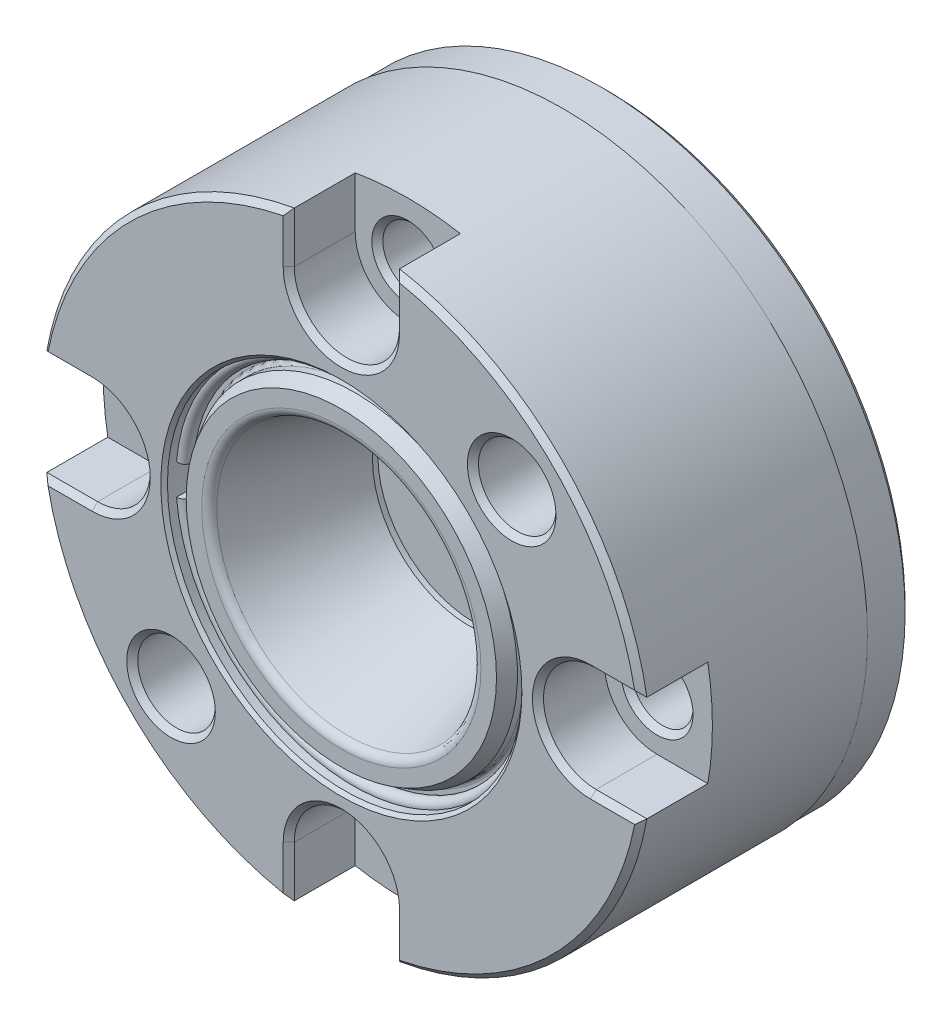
ISO-10303-21;
HEADER;
FILE_DESCRIPTION(('STEP AP214'),'2;1');
FILE_NAME('part.step','',(''),(''),'','','');
FILE_SCHEMA(('AUTOMOTIVE_DESIGN { 1 0 10303 214 1 1 1 1 }'));
ENDSEC;
DATA;
#1=APPLICATION_CONTEXT('core data for automotive mechanical design processes');
#2=APPLICATION_PROTOCOL_DEFINITION('international standard','automotive_design',2000,#1);
#3=PRODUCT_CONTEXT('',#1,'mechanical');
#4=PRODUCT('Part','Part','',(#3));
#5=PRODUCT_RELATED_PRODUCT_CATEGORY('part','',(#4));
#6=PRODUCT_DEFINITION_FORMATION('','',#4);
#7=PRODUCT_DEFINITION_CONTEXT('part definition',#1,'design');
#8=PRODUCT_DEFINITION('design','',#6,#7);
#9=PRODUCT_DEFINITION_SHAPE('','',#8);
#10=(LENGTH_UNIT() NAMED_UNIT(*) SI_UNIT(.MILLI.,.METRE.));
#11=(NAMED_UNIT(*) PLANE_ANGLE_UNIT() SI_UNIT($,.RADIAN.));
#12=(NAMED_UNIT(*) SI_UNIT($,.STERADIAN.) SOLID_ANGLE_UNIT());
#13=UNCERTAINTY_MEASURE_WITH_UNIT(LENGTH_MEASURE(1.E-05),#10,'distance_accuracy_value','');
#14=(GEOMETRIC_REPRESENTATION_CONTEXT(3) GLOBAL_UNCERTAINTY_ASSIGNED_CONTEXT((#13)) GLOBAL_UNIT_ASSIGNED_CONTEXT((#10,
#11,#12)) REPRESENTATION_CONTEXT('',''));
#15=CARTESIAN_POINT('',(0.,0.,0.));
#16=DIRECTION('',(0.,0.,1.));
#17=DIRECTION('',(1.,0.,0.));
#18=AXIS2_PLACEMENT_3D('',#15,#16,#17);
#19=CARTESIAN_POINT('',(0.,0.,22.35));
#20=DIRECTION('',(0.,0.,-1.));
#21=DIRECTION('',(1.,0.,0.));
#22=AXIS2_PLACEMENT_3D('',#19,#20,#21);
#23=TOROIDAL_SURFACE('',#22,15.9,0.6);
#24=CARTESIAN_POINT('',(0.,0.,22.9416079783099));
#25=DIRECTION('',(0.,0.,-1.));
#26=DIRECTION('',(0.,1.,0.));
#27=AXIS2_PLACEMENT_3D('',#24,#25,#26);
#28=CIRCLE('',#27,16.);
#29=CARTESIAN_POINT('',(-15.939115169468,1.39449188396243,22.9416079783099));
#30=VERTEX_POINT('',#29);
#31=CARTESIAN_POINT('',(-15.939115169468,-1.39449188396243,22.9416079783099));
#32=VERTEX_POINT('',#31);
#33=EDGE_CURVE('E9',#30,#32,#28,.T.);
#34=ORIENTED_EDGE('',*,*,#33,.F.);
#35=CARTESIAN_POINT('',(-15.8394956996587,1.38577630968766,22.35));
#36=DIRECTION('',(0.0871557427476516,0.996194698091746,0.));
#37=DIRECTION('',(0.,0.,-1.));
#38=AXIS2_PLACEMENT_3D('',#35,#36,#37);
#39=CIRCLE('',#38,0.6);
#40=CARTESIAN_POINT('',(-15.8394956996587,1.38577630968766,21.75));
#41=VERTEX_POINT('',#40);
#42=EDGE_CURVE('E212',#30,#41,#39,.T.);
#43=ORIENTED_EDGE('',*,*,#42,.T.);
#44=CARTESIAN_POINT('',(0.,0.,21.75));
#45=DIRECTION('',(0.,0.,1.));
#46=DIRECTION('',(-1.,0.,0.));
#47=AXIS2_PLACEMENT_3D('',#44,#45,#46);
#48=CIRCLE('',#47,15.9);
#49=CARTESIAN_POINT('',(-15.8394956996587,-1.38577630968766,21.75));
#50=VERTEX_POINT('',#49);
#51=EDGE_CURVE('E193',#50,#41,#48,.T.);
#52=ORIENTED_EDGE('',*,*,#51,.F.);
#53=CARTESIAN_POINT('',(-15.8394956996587,-1.38577630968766,22.35));
#54=DIRECTION('',(-0.0871557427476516,0.996194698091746,0.));
#55=DIRECTION('',(0.,0.,-1.));
#56=AXIS2_PLACEMENT_3D('',#53,#54,#55);
#57=CIRCLE('',#56,0.6);
#58=EDGE_CURVE('E252',#32,#50,#57,.T.);
#59=ORIENTED_EDGE('',*,*,#58,.F.);
#60=EDGE_LOOP('',(#34,#43,#52,#59));
#61=FACE_BOUND('',#60,.T.);
#62=ADVANCED_FACE('F14',(#61),#23,.T.);
#63=CARTESIAN_POINT('',(-15.8394956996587,1.38577630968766,22.35));
#64=DIRECTION('',(0.0871557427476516,0.996194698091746,0.));
#65=DIRECTION('',(0.,0.,-1.));
#66=AXIS2_PLACEMENT_3D('',#63,#64,#65);
#67=PLANE('',#66);
#68=ORIENTED_EDGE('',*,*,#42,.F.);
#69=DIRECTION('',(0.,0.,-1.));
#70=VECTOR('',#69,1.);
#71=CARTESIAN_POINT('',(-15.939115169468,1.39449188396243,0.));
#72=LINE('',#71,#70);
#73=CARTESIAN_POINT('',(-15.939115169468,1.39449188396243,21.75));
#74=VERTEX_POINT('',#73);
#75=EDGE_CURVE('E18',#30,#74,#72,.T.);
#76=ORIENTED_EDGE('',*,*,#75,.T.);
#77=DIRECTION('',(0.996194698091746,-0.0871557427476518,0.));
#78=VECTOR('',#77,1.);
#79=CARTESIAN_POINT('',(-16.8204097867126,1.47159517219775,21.75));
#80=LINE('',#79,#78);
#81=EDGE_CURVE('E203',#74,#41,#80,.T.);
#82=ORIENTED_EDGE('',*,*,#81,.T.);
#83=EDGE_LOOP('',(#68,#76,#82));
#84=FACE_BOUND('',#83,.T.);
#85=ADVANCED_FACE('F211',(#84),#67,.F.);
#86=CARTESIAN_POINT('',(-15.8394956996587,-1.38577630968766,22.35));
#87=DIRECTION('',(-0.0871557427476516,0.996194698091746,0.));
#88=DIRECTION('',(0.,0.,-1.));
#89=AXIS2_PLACEMENT_3D('',#86,#87,#88);
#90=PLANE('',#89);
#91=DIRECTION('',(0.,0.,-1.));
#92=VECTOR('',#91,1.);
#93=CARTESIAN_POINT('',(-15.939115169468,-1.39449188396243,0.));
#94=LINE('',#93,#92);
#95=CARTESIAN_POINT('',(-15.939115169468,-1.39449188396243,21.75));
#96=VERTEX_POINT('',#95);
#97=EDGE_CURVE('E213',#32,#96,#94,.T.);
#98=ORIENTED_EDGE('',*,*,#97,.F.);
#99=ORIENTED_EDGE('',*,*,#58,.T.);
#100=DIRECTION('',(0.996194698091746,0.0871557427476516,0.));
#101=VECTOR('',#100,1.);
#102=CARTESIAN_POINT('',(-16.5649209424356,-1.44924279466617,21.75));
#103=LINE('',#102,#101);
#104=EDGE_CURVE('E209',#96,#50,#103,.T.);
#105=ORIENTED_EDGE('',*,*,#104,.F.);
#106=EDGE_LOOP('',(#98,#99,#105));
#107=FACE_BOUND('',#106,.T.);
#108=ADVANCED_FACE('F622',(#107),#90,.T.);
#109=CARTESIAN_POINT('',(0.,0.,6.5));
#110=DIRECTION('',(0.,0.,1.));
#111=DIRECTION('',(1.,0.,0.));
#112=AXIS2_PLACEMENT_3D('',#109,#110,#111);
#113=TOROIDAL_SURFACE('',#112,9.2,1.2);
#114=CARTESIAN_POINT('',(0.,0.,7.7));
#115=DIRECTION('',(0.,0.,1.));
#116=DIRECTION('',(1.,0.,0.));
#117=AXIS2_PLACEMENT_3D('',#114,#115,#116);
#118=CIRCLE('',#117,9.2);
#119=CARTESIAN_POINT('',(9.2,0.,7.7));
#120=VERTEX_POINT('',#119);
#121=EDGE_CURVE('E1604',#120,#120,#118,.F.);
#122=ORIENTED_EDGE('',*,*,#121,.F.);
#123=EDGE_LOOP('',(#122));
#124=FACE_BOUND('',#123,.T.);
#125=CARTESIAN_POINT('',(0.,0.,6.5));
#126=DIRECTION('',(0.,0.,1.));
#127=DIRECTION('',(1.,0.,0.));
#128=AXIS2_PLACEMENT_3D('',#125,#126,#127);
#129=CIRCLE('',#128,8.);
#130=CARTESIAN_POINT('',(8.,0.,6.5));
#131=VERTEX_POINT('',#130);
#132=EDGE_CURVE('E602',#131,#131,#129,.T.);
#133=ORIENTED_EDGE('',*,*,#132,.F.);
#134=EDGE_LOOP('',(#133));
#135=FACE_BOUND('',#134,.T.);
#136=ADVANCED_FACE('F615',(#124,#135),#113,.T.);
#137=CARTESIAN_POINT('',(0.,0.,7.7));
#138=DIRECTION('',(0.,0.,1.));
#139=DIRECTION('',(1.,0.,0.));
#140=AXIS2_PLACEMENT_3D('',#137,#138,#139);
#141=PLANE('',#140);
#142=ORIENTED_EDGE('',*,*,#121,.T.);
#143=EDGE_LOOP('',(#142));
#144=FACE_BOUND('',#143,.T.);
#145=CARTESIAN_POINT('',(0.,0.,7.7));
#146=DIRECTION('',(0.,0.,1.));
#147=DIRECTION('',(1.,0.,0.));
#148=AXIS2_PLACEMENT_3D('',#145,#146,#147);
#149=CIRCLE('',#148,15.8);
#150=CARTESIAN_POINT('',(15.8,0.,7.7));
#151=VERTEX_POINT('',#150);
#152=EDGE_CURVE('E483',#151,#151,#149,.T.);
#153=ORIENTED_EDGE('',*,*,#152,.T.);
#154=EDGE_LOOP('',(#153));
#155=FACE_BOUND('',#154,.T.);
#156=ADVANCED_FACE('F621',(#144,#155),#141,.T.);
#157=CARTESIAN_POINT('',(0.,0.,24.));
#158=DIRECTION('',(0.,0.,-1.));
#159=DIRECTION('',(-1.,0.,0.));
#160=AXIS2_PLACEMENT_3D('',#157,#158,#159);
#161=CYLINDRICAL_SURFACE('',#160,8.);
#162=CARTESIAN_POINT('',(0.,0.,5.45764939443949));
#163=DIRECTION('',(0.,0.,-1.));
#164=DIRECTION('',(-1.,0.,0.));
#165=AXIS2_PLACEMENT_3D('',#162,#163,#164);
#166=CIRCLE('',#165,8.);
#167=CARTESIAN_POINT('',(-8.,0.,5.45764939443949));
#168=VERTEX_POINT('',#167);
#169=EDGE_CURVE('E1586',#168,#168,#166,.T.);
#170=ORIENTED_EDGE('',*,*,#169,.T.);
#171=EDGE_LOOP('',(#170));
#172=FACE_BOUND('',#171,.T.);
#173=ORIENTED_EDGE('',*,*,#132,.T.);
#174=EDGE_LOOP('',(#173));
#175=FACE_BOUND('',#174,.T.);
#176=ADVANCED_FACE('F754',(#172,#175),#161,.F.);
#177=CARTESIAN_POINT('',(0.,0.,8.1));
#178=DIRECTION('',(0.,0.,1.));
#179=DIRECTION('',(1.,0.,0.));
#180=AXIS2_PLACEMENT_3D('',#177,#178,#179);
#181=TOROIDAL_SURFACE('',#180,15.8,0.4);
#182=CARTESIAN_POINT('',(0.,0.,8.1));
#183=DIRECTION('',(0.,0.,1.));
#184=DIRECTION('',(1.,0.,0.));
#185=AXIS2_PLACEMENT_3D('',#182,#183,#184);
#186=CIRCLE('',#185,16.2);
#187=CARTESIAN_POINT('',(16.2,0.,8.1));
#188=VERTEX_POINT('',#187);
#189=EDGE_CURVE('E506',#188,#188,#186,.F.);
#190=ORIENTED_EDGE('',*,*,#189,.F.);
#191=EDGE_LOOP('',(#190));
#192=FACE_BOUND('',#191,.T.);
#193=ORIENTED_EDGE('',*,*,#152,.F.);
#194=EDGE_LOOP('',(#193));
#195=FACE_BOUND('',#194,.T.);
#196=ADVANCED_FACE('F634',(#192,#195),#181,.F.);
#197=CARTESIAN_POINT('',(0.,0.,5.45764939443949));
#198=DIRECTION('',(0.,0.,-1.));
#199=DIRECTION('',(-1.,0.,0.));
#200=AXIS2_PLACEMENT_3D('',#197,#198,#199);
#201=TOROIDAL_SURFACE('',#200,8.5,0.5);
#202=ORIENTED_EDGE('',*,*,#169,.F.);
#203=EDGE_LOOP('',(#202));
#204=FACE_BOUND('',#203,.T.);
#205=CARTESIAN_POINT('',(0.,0.,5.17086117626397));
#206=DIRECTION('',(0.,0.,-1.));
#207=DIRECTION('',(-1.,0.,0.));
#208=AXIS2_PLACEMENT_3D('',#205,#206,#207);
#209=CIRCLE('',#208,8.0904239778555);
#210=CARTESIAN_POINT('',(-8.0904239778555,0.,5.17086117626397));
#211=VERTEX_POINT('',#210);
#212=EDGE_CURVE('E1607',#211,#211,#209,.F.);
#213=ORIENTED_EDGE('',*,*,#212,.F.);
#214=EDGE_LOOP('',(#213));
#215=FACE_BOUND('',#214,.T.);
#216=ADVANCED_FACE('F630',(#204,#215),#201,.T.);
#217=CARTESIAN_POINT('',(0.,0.,0.));
#218=DIRECTION('',(0.,0.,1.));
#219=DIRECTION('',(1.,0.,0.));
#220=AXIS2_PLACEMENT_3D('',#217,#218,#219);
#221=CYLINDRICAL_SURFACE('',#220,16.2);
#222=ORIENTED_EDGE('',*,*,#189,.T.);
#223=EDGE_LOOP('',(#222));
#224=FACE_BOUND('',#223,.T.);
#225=CARTESIAN_POINT('',(0.,0.,11.5));
#226=DIRECTION('',(0.,0.,1.));
#227=DIRECTION('',(1.,0.,0.));
#228=AXIS2_PLACEMENT_3D('',#225,#226,#227);
#229=CIRCLE('',#228,16.2);
#230=CARTESIAN_POINT('',(16.2,0.,11.5));
#231=VERTEX_POINT('',#230);
#232=EDGE_CURVE('E280',#231,#231,#229,.T.);
#233=ORIENTED_EDGE('',*,*,#232,.T.);
#234=EDGE_LOOP('',(#233));
#235=FACE_BOUND('',#234,.T.);
#236=ADVANCED_FACE('F633',(#224,#235),#221,.F.);
#237=CARTESIAN_POINT('',(0.,0.,0.));
#238=DIRECTION('',(0.,0.,-1.));
#239=DIRECTION('',(-1.,0.,0.));
#240=AXIS2_PLACEMENT_3D('',#237,#238,#239);
#241=CONICAL_SURFACE('',#240,11.7110999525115,0.610865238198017);
#242=ORIENTED_EDGE('',*,*,#212,.T.);
#243=EDGE_LOOP('',(#242));
#244=FACE_BOUND('',#243,.T.);
#245=CARTESIAN_POINT('',(0.,0.,0.341138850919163));
#246=DIRECTION('',(0.,0.,1.));
#247=DIRECTION('',(1.,0.,0.));
#248=AXIS2_PLACEMENT_3D('',#245,#246,#247);
#249=CIRCLE('',#248,11.4722319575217);
#250=CARTESIAN_POINT('',(11.4722319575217,0.,0.341138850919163));
#251=VERTEX_POINT('',#250);
#252=EDGE_CURVE('E1603',#251,#251,#249,.F.);
#253=ORIENTED_EDGE('',*,*,#252,.T.);
#254=EDGE_LOOP('',(#253));
#255=FACE_BOUND('',#254,.T.);
#256=ADVANCED_FACE('F693',(#244,#255),#241,.F.);
#257=CARTESIAN_POINT('',(-16.,0.,11.5));
#258=DIRECTION('',(0.,0.,-1.));
#259=DIRECTION('',(-1.,0.,0.));
#260=AXIS2_PLACEMENT_3D('',#257,#258,#259);
#261=PLANE('',#260);
#262=CARTESIAN_POINT('',(0.,0.,11.5));
#263=DIRECTION('',(0.,0.,1.));
#264=DIRECTION('',(1.,0.,0.));
#265=AXIS2_PLACEMENT_3D('',#262,#263,#264);
#266=CIRCLE('',#265,16.);
#267=CARTESIAN_POINT('',(16.,0.,11.5));
#268=VERTEX_POINT('',#267);
#269=EDGE_CURVE('E277',#268,#268,#266,.T.);
#270=ORIENTED_EDGE('',*,*,#269,.T.);
#271=EDGE_LOOP('',(#270));
#272=FACE_BOUND('',#271,.T.);
#273=ORIENTED_EDGE('',*,*,#232,.F.);
#274=EDGE_LOOP('',(#273));
#275=FACE_BOUND('',#274,.T.);
#276=ADVANCED_FACE('F628',(#272,#275),#261,.T.);
#277=CARTESIAN_POINT('',(0.,0.,0.8));
#278=DIRECTION('',(0.,0.,-1.));
#279=DIRECTION('',(-1.,0.,0.));
#280=AXIS2_PLACEMENT_3D('',#277,#278,#279);
#281=TOROIDAL_SURFACE('',#280,12.1275535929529,0.8);
#282=ORIENTED_EDGE('',*,*,#252,.F.);
#283=EDGE_LOOP('',(#282));
#284=FACE_BOUND('',#283,.T.);
#285=CARTESIAN_POINT('',(0.,0.,0.));
#286=DIRECTION('',(0.,0.,-1.));
#287=DIRECTION('',(-1.,0.,0.));
#288=AXIS2_PLACEMENT_3D('',#285,#286,#287);
#289=CIRCLE('',#288,12.1275535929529);
#290=CARTESIAN_POINT('',(-12.1275535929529,0.,0.));
#291=VERTEX_POINT('',#290);
#292=EDGE_CURVE('E1601',#291,#291,#289,.F.);
#293=ORIENTED_EDGE('',*,*,#292,.F.);
#294=EDGE_LOOP('',(#293));
#295=FACE_BOUND('',#294,.T.);
#296=ADVANCED_FACE('F624',(#284,#295),#281,.T.);
#297=CARTESIAN_POINT('',(0.,0.,0.));
#298=DIRECTION('',(0.,0.,-1.));
#299=DIRECTION('',(-1.,0.,0.));
#300=AXIS2_PLACEMENT_3D('',#297,#298,#299);
#301=CYLINDRICAL_SURFACE('',#300,16.);
#302=CARTESIAN_POINT('',(0.,0.,12.));
#303=DIRECTION('',(0.,0.,-1.));
#304=DIRECTION('',(1.,0.,0.));
#305=AXIS2_PLACEMENT_3D('',#302,#303,#304);
#306=CIRCLE('',#305,16.);
#307=CARTESIAN_POINT('',(16.,0.,12.));
#308=VERTEX_POINT('',#307);
#309=EDGE_CURVE('E216',#308,#308,#306,.T.);
#310=ORIENTED_EDGE('',*,*,#309,.F.);
#311=EDGE_LOOP('',(#310));
#312=FACE_BOUND('',#311,.T.);
#313=ORIENTED_EDGE('',*,*,#269,.F.);
#314=EDGE_LOOP('',(#313));
#315=FACE_BOUND('',#314,.T.);
#316=ADVANCED_FACE('F627',(#312,#315),#301,.F.);
#317=CARTESIAN_POINT('',(-22.5,0.,0.));
#318=DIRECTION('',(0.,0.,-1.));
#319=DIRECTION('',(-1.,0.,0.));
#320=AXIS2_PLACEMENT_3D('',#317,#318,#319);
#321=CONICAL_SURFACE('',#320,3.25,0.785398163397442);
#322=CARTESIAN_POINT('',(-22.5,0.,0.499999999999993));
#323=DIRECTION('',(0.,0.,-1.));
#324=DIRECTION('',(-1.,0.,0.));
#325=AXIS2_PLACEMENT_3D('',#322,#323,#324);
#326=CIRCLE('',#325,2.75);
#327=CARTESIAN_POINT('',(-25.25,0.,0.499999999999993));
#328=VERTEX_POINT('',#327);
#329=EDGE_CURVE('E385',#328,#328,#326,.T.);
#330=ORIENTED_EDGE('',*,*,#329,.F.);
#331=EDGE_LOOP('',(#330));
#332=FACE_BOUND('',#331,.T.);
#333=CARTESIAN_POINT('',(-22.5,0.,0.));
#334=DIRECTION('',(0.,0.,-1.));
#335=DIRECTION('',(-1.,0.,0.));
#336=AXIS2_PLACEMENT_3D('',#333,#334,#335);
#337=CIRCLE('',#336,3.25);
#338=CARTESIAN_POINT('',(-25.75,0.,0.));
#339=VERTEX_POINT('',#338);
#340=EDGE_CURVE('E371',#339,#339,#337,.F.);
#341=ORIENTED_EDGE('',*,*,#340,.F.);
#342=EDGE_LOOP('',(#341));
#343=FACE_BOUND('',#342,.T.);
#344=ADVANCED_FACE('F820',(#332,#343),#321,.F.);
#345=CARTESIAN_POINT('',(0.,-22.5,0.));
#346=DIRECTION('',(0.,0.,-1.));
#347=DIRECTION('',(-1.,0.,0.));
#348=AXIS2_PLACEMENT_3D('',#345,#346,#347);
#349=CONICAL_SURFACE('',#348,3.25,0.785398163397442);
#350=CARTESIAN_POINT('',(0.,-22.5,0.499999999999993));
#351=DIRECTION('',(0.,0.,-1.));
#352=DIRECTION('',(-1.,0.,0.));
#353=AXIS2_PLACEMENT_3D('',#350,#351,#352);
#354=CIRCLE('',#353,2.75);
#355=CARTESIAN_POINT('',(-2.74999999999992,-22.5,0.499999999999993));
#356=VERTEX_POINT('',#355);
#357=EDGE_CURVE('E397',#356,#356,#354,.T.);
#358=ORIENTED_EDGE('',*,*,#357,.F.);
#359=EDGE_LOOP('',(#358));
#360=FACE_BOUND('',#359,.T.);
#361=CARTESIAN_POINT('',(0.,-22.5,0.));
#362=DIRECTION('',(0.,0.,-1.));
#363=DIRECTION('',(-1.,0.,0.));
#364=AXIS2_PLACEMENT_3D('',#361,#362,#363);
#365=CIRCLE('',#364,3.25);
#366=CARTESIAN_POINT('',(-3.24999999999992,-22.5,0.));
#367=VERTEX_POINT('',#366);
#368=EDGE_CURVE('E391',#367,#367,#365,.F.);
#369=ORIENTED_EDGE('',*,*,#368,.F.);
#370=EDGE_LOOP('',(#369));
#371=FACE_BOUND('',#370,.T.);
#372=ADVANCED_FACE('F761',(#360,#371),#349,.F.);
#373=CARTESIAN_POINT('',(22.5,1.59872115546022E-13,0.));
#374=DIRECTION('',(0.,0.,-1.));
#375=DIRECTION('',(-1.,0.,0.));
#376=AXIS2_PLACEMENT_3D('',#373,#374,#375);
#377=CONICAL_SURFACE('',#376,3.25,0.785398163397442);
#378=CARTESIAN_POINT('',(22.5,1.59872115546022E-13,0.499999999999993));
#379=DIRECTION('',(0.,0.,-1.));
#380=DIRECTION('',(-1.,0.,0.));
#381=AXIS2_PLACEMENT_3D('',#378,#379,#380);
#382=CIRCLE('',#381,2.75);
#383=CARTESIAN_POINT('',(19.75,1.59872115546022E-13,0.499999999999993));
#384=VERTEX_POINT('',#383);
#385=EDGE_CURVE('E409',#384,#384,#382,.T.);
#386=ORIENTED_EDGE('',*,*,#385,.F.);
#387=EDGE_LOOP('',(#386));
#388=FACE_BOUND('',#387,.T.);
#389=CARTESIAN_POINT('',(22.5,1.59872115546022E-13,0.));
#390=DIRECTION('',(0.,0.,-1.));
#391=DIRECTION('',(-1.,0.,0.));
#392=AXIS2_PLACEMENT_3D('',#389,#390,#391);
#393=CIRCLE('',#392,3.25);
#394=CARTESIAN_POINT('',(19.25,1.59872115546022E-13,0.));
#395=VERTEX_POINT('',#394);
#396=EDGE_CURVE('E403',#395,#395,#393,.F.);
#397=ORIENTED_EDGE('',*,*,#396,.F.);
#398=EDGE_LOOP('',(#397));
#399=FACE_BOUND('',#398,.T.);
#400=ADVANCED_FACE('F857',(#388,#399),#377,.F.);
#401=CARTESIAN_POINT('',(-2.38430445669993E-13,22.5,0.));
#402=DIRECTION('',(0.,0.,-1.));
#403=DIRECTION('',(-1.,0.,0.));
#404=AXIS2_PLACEMENT_3D('',#401,#402,#403);
#405=CONICAL_SURFACE('',#404,3.25,0.785398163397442);
#406=CARTESIAN_POINT('',(-2.38429387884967E-13,22.5,0.499999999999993));
#407=DIRECTION('',(0.,0.,-1.));
#408=DIRECTION('',(-1.,0.,0.));
#409=AXIS2_PLACEMENT_3D('',#406,#407,#408);
#410=CIRCLE('',#409,2.75);
#411=CARTESIAN_POINT('',(-2.75000000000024,22.5,0.499999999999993));
#412=VERTEX_POINT('',#411);
#413=EDGE_CURVE('E421',#412,#412,#410,.T.);
#414=ORIENTED_EDGE('',*,*,#413,.F.);
#415=EDGE_LOOP('',(#414));
#416=FACE_BOUND('',#415,.T.);
#417=CARTESIAN_POINT('',(-2.38430445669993E-13,22.5,0.));
#418=DIRECTION('',(0.,0.,-1.));
#419=DIRECTION('',(-1.,0.,0.));
#420=AXIS2_PLACEMENT_3D('',#417,#418,#419);
#421=CIRCLE('',#420,3.25);
#422=CARTESIAN_POINT('',(-3.25000000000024,22.5,0.));
#423=VERTEX_POINT('',#422);
#424=EDGE_CURVE('E415',#423,#423,#421,.F.);
#425=ORIENTED_EDGE('',*,*,#424,.F.);
#426=EDGE_LOOP('',(#425));
#427=FACE_BOUND('',#426,.T.);
#428=ADVANCED_FACE('F840',(#416,#427),#405,.F.);
#429=CARTESIAN_POINT('',(-27.5,0.,0.));
#430=DIRECTION('',(0.,0.,-1.));
#431=DIRECTION('',(-1.,0.,0.));
#432=AXIS2_PLACEMENT_3D('',#429,#430,#431);
#433=PLANE('',#432);
#434=CARTESIAN_POINT('',(15.3795724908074,15.3795724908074,0.));
#435=DIRECTION('',(0.,0.,1.));
#436=DIRECTION('',(1.,0.,0.));
#437=AXIS2_PLACEMENT_3D('',#434,#435,#436);
#438=CIRCLE('',#437,3.5);
#439=CARTESIAN_POINT('',(18.8795724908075,15.3795724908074,0.));
#440=VERTEX_POINT('',#439);
#441=EDGE_CURVE('E268',#440,#440,#438,.T.);
#442=ORIENTED_EDGE('',*,*,#441,.T.);
#443=EDGE_LOOP('',(#442));
#444=FACE_BOUND('',#443,.T.);
#445=CARTESIAN_POINT('',(-15.3795724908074,-15.3795724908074,0.));
#446=DIRECTION('',(0.,0.,1.));
#447=DIRECTION('',(1.,0.,0.));
#448=AXIS2_PLACEMENT_3D('',#445,#446,#447);
#449=CIRCLE('',#448,3.5);
#450=CARTESIAN_POINT('',(-11.8795724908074,-15.3795724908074,0.));
#451=VERTEX_POINT('',#450);
#452=EDGE_CURVE('E274',#451,#451,#449,.T.);
#453=ORIENTED_EDGE('',*,*,#452,.T.);
#454=EDGE_LOOP('',(#453));
#455=FACE_BOUND('',#454,.T.);
#456=ORIENTED_EDGE('',*,*,#292,.T.);
#457=EDGE_LOOP('',(#456));
#458=FACE_BOUND('',#457,.T.);
#459=CARTESIAN_POINT('',(0.,0.,0.));
#460=DIRECTION('',(0.,0.,-1.));
#461=DIRECTION('',(-1.,0.,0.));
#462=AXIS2_PLACEMENT_3D('',#459,#460,#461);
#463=CIRCLE('',#462,26.9);
#464=CARTESIAN_POINT('',(-26.9,0.,0.));
#465=VERTEX_POINT('',#464);
#466=EDGE_CURVE('E515',#465,#465,#463,.T.);
#467=ORIENTED_EDGE('',*,*,#466,.T.);
#468=EDGE_LOOP('',(#467));
#469=FACE_BOUND('',#468,.T.);
#470=ORIENTED_EDGE('',*,*,#340,.T.);
#471=EDGE_LOOP('',(#470));
#472=FACE_BOUND('',#471,.T.);
#473=ORIENTED_EDGE('',*,*,#368,.T.);
#474=EDGE_LOOP('',(#473));
#475=FACE_BOUND('',#474,.T.);
#476=ORIENTED_EDGE('',*,*,#396,.T.);
#477=EDGE_LOOP('',(#476));
#478=FACE_BOUND('',#477,.T.);
#479=ORIENTED_EDGE('',*,*,#424,.T.);
#480=EDGE_LOOP('',(#479));
#481=FACE_BOUND('',#480,.T.);
#482=ADVANCED_FACE('F673',(#444,#455,#458,#469,#472,#475,#478,#481),#433,.T.);
#483=CARTESIAN_POINT('',(-16.,0.,12.));
#484=DIRECTION('',(0.,0.,-1.));
#485=DIRECTION('',(1.,0.,0.));
#486=AXIS2_PLACEMENT_3D('',#483,#484,#485);
#487=PLANE('',#486);
#488=ORIENTED_EDGE('',*,*,#309,.T.);
#489=EDGE_LOOP('',(#488));
#490=FACE_BOUND('',#489,.T.);
#491=CARTESIAN_POINT('',(0.,0.,12.));
#492=DIRECTION('',(0.,0.,1.));
#493=DIRECTION('',(-1.,0.,0.));
#494=AXIS2_PLACEMENT_3D('',#491,#492,#493);
#495=CIRCLE('',#494,8.7);
#496=CARTESIAN_POINT('',(-8.7,0.,12.));
#497=VERTEX_POINT('',#496);
#498=EDGE_CURVE('E228',#497,#497,#495,.T.);
#499=ORIENTED_EDGE('',*,*,#498,.T.);
#500=EDGE_LOOP('',(#499));
#501=FACE_BOUND('',#500,.T.);
#502=ADVANCED_FACE('F654',(#490,#501),#487,.T.);
#503=CARTESIAN_POINT('',(-22.5,0.,0.));
#504=DIRECTION('',(0.,0.,1.));
#505=DIRECTION('',(1.,0.,0.));
#506=AXIS2_PLACEMENT_3D('',#503,#504,#505);
#507=CYLINDRICAL_SURFACE('',#506,2.75);
#508=ORIENTED_EDGE('',*,*,#329,.T.);
#509=EDGE_LOOP('',(#508));
#510=FACE_BOUND('',#509,.T.);
#511=CARTESIAN_POINT('',(-22.5,0.,17.5));
#512=DIRECTION('',(0.,0.,1.));
#513=DIRECTION('',(1.,0.,0.));
#514=AXIS2_PLACEMENT_3D('',#511,#512,#513);
#515=CIRCLE('',#514,2.75);
#516=CARTESIAN_POINT('',(-19.75,0.,17.5));
#517=VERTEX_POINT('',#516);
#518=EDGE_CURVE('E382',#517,#517,#515,.T.);
#519=ORIENTED_EDGE('',*,*,#518,.T.);
#520=EDGE_LOOP('',(#519));
#521=FACE_BOUND('',#520,.T.);
#522=ADVANCED_FACE('F672',(#510,#521),#507,.F.);
#523=CARTESIAN_POINT('',(0.,-22.5,0.));
#524=DIRECTION('',(0.,0.,1.));
#525=DIRECTION('',(1.,0.,0.));
#526=AXIS2_PLACEMENT_3D('',#523,#524,#525);
#527=CYLINDRICAL_SURFACE('',#526,2.75);
#528=ORIENTED_EDGE('',*,*,#357,.T.);
#529=EDGE_LOOP('',(#528));
#530=FACE_BOUND('',#529,.T.);
#531=CARTESIAN_POINT('',(0.,-22.5,17.5));
#532=DIRECTION('',(0.,0.,1.));
#533=DIRECTION('',(1.,0.,0.));
#534=AXIS2_PLACEMENT_3D('',#531,#532,#533);
#535=CIRCLE('',#534,2.75);
#536=CARTESIAN_POINT('',(2.75000000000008,-22.5,17.5));
#537=VERTEX_POINT('',#536);
#538=EDGE_CURVE('E394',#537,#537,#535,.T.);
#539=ORIENTED_EDGE('',*,*,#538,.T.);
#540=EDGE_LOOP('',(#539));
#541=FACE_BOUND('',#540,.T.);
#542=ADVANCED_FACE('F765',(#530,#541),#527,.F.);
#543=CARTESIAN_POINT('',(22.5,1.59872115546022E-13,0.));
#544=DIRECTION('',(0.,0.,1.));
#545=DIRECTION('',(1.,0.,0.));
#546=AXIS2_PLACEMENT_3D('',#543,#544,#545);
#547=CYLINDRICAL_SURFACE('',#546,2.75);
#548=ORIENTED_EDGE('',*,*,#385,.T.);
#549=EDGE_LOOP('',(#548));
#550=FACE_BOUND('',#549,.T.);
#551=CARTESIAN_POINT('',(22.5,1.59872115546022E-13,17.5));
#552=DIRECTION('',(0.,0.,1.));
#553=DIRECTION('',(1.,0.,0.));
#554=AXIS2_PLACEMENT_3D('',#551,#552,#553);
#555=CIRCLE('',#554,2.75);
#556=CARTESIAN_POINT('',(25.25,1.59872115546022E-13,17.5));
#557=VERTEX_POINT('',#556);
#558=EDGE_CURVE('E406',#557,#557,#555,.T.);
#559=ORIENTED_EDGE('',*,*,#558,.T.);
#560=EDGE_LOOP('',(#559));
#561=FACE_BOUND('',#560,.T.);
#562=ADVANCED_FACE('F762',(#550,#561),#547,.F.);
#563=CARTESIAN_POINT('',(0.,0.,0.));
#564=DIRECTION('',(0.,0.,1.));
#565=DIRECTION('',(1.,0.,0.));
#566=AXIS2_PLACEMENT_3D('',#563,#564,#565);
#567=CONICAL_SURFACE('',#566,26.9,0.785398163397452);
#568=CARTESIAN_POINT('',(0.,0.,0.500000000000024));
#569=DIRECTION('',(0.,0.,-1.));
#570=DIRECTION('',(-1.,0.,0.));
#571=AXIS2_PLACEMENT_3D('',#568,#569,#570);
#572=CIRCLE('',#571,27.4);
#573=CARTESIAN_POINT('',(-27.4,0.,0.500000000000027));
#574=VERTEX_POINT('',#573);
#575=EDGE_CURVE('E518',#574,#574,#572,.F.);
#576=ORIENTED_EDGE('',*,*,#575,.F.);
#577=EDGE_LOOP('',(#576));
#578=FACE_BOUND('',#577,.T.);
#579=ORIENTED_EDGE('',*,*,#466,.F.);
#580=EDGE_LOOP('',(#579));
#581=FACE_BOUND('',#580,.T.);
#582=ADVANCED_FACE('F555',(#578,#581),#567,.T.);
#583=CARTESIAN_POINT('',(-2.38430445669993E-13,22.5,0.));
#584=DIRECTION('',(0.,0.,1.));
#585=DIRECTION('',(1.,0.,0.));
#586=AXIS2_PLACEMENT_3D('',#583,#584,#585);
#587=CYLINDRICAL_SURFACE('',#586,2.75);
#588=ORIENTED_EDGE('',*,*,#413,.T.);
#589=EDGE_LOOP('',(#588));
#590=FACE_BOUND('',#589,.T.);
#591=CARTESIAN_POINT('',(-2.38393423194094E-13,22.5,17.5));
#592=DIRECTION('',(0.,0.,1.));
#593=DIRECTION('',(1.,0.,0.));
#594=AXIS2_PLACEMENT_3D('',#591,#592,#593);
#595=CIRCLE('',#594,2.75);
#596=CARTESIAN_POINT('',(2.74999999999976,22.5,17.5));
#597=VERTEX_POINT('',#596);
#598=EDGE_CURVE('E418',#597,#597,#595,.T.);
#599=ORIENTED_EDGE('',*,*,#598,.T.);
#600=EDGE_LOOP('',(#599));
#601=FACE_BOUND('',#600,.T.);
#602=ADVANCED_FACE('F721',(#590,#601),#587,.F.);
#603=CARTESIAN_POINT('',(15.3795724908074,15.3795724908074,1.));
#604=DIRECTION('',(0.,0.,-1.));
#605=DIRECTION('',(-1.,0.,0.));
#606=AXIS2_PLACEMENT_3D('',#603,#604,#605);
#607=CONICAL_SURFACE('',#606,2.5,0.785398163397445);
#608=CARTESIAN_POINT('',(15.3795724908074,15.3795724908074,0.5));
#609=DIRECTION('',(0.,0.,-1.));
#610=DIRECTION('',(-1.,0.,0.));
#611=AXIS2_PLACEMENT_3D('',#608,#609,#610);
#612=CIRCLE('',#611,3.);
#613=CARTESIAN_POINT('',(12.3795724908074,15.3795724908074,0.5));
#614=VERTEX_POINT('',#613);
#615=EDGE_CURVE('E262',#614,#614,#612,.F.);
#616=ORIENTED_EDGE('',*,*,#615,.T.);
#617=EDGE_LOOP('',(#616));
#618=FACE_BOUND('',#617,.T.);
#619=ORIENTED_EDGE('',*,*,#441,.F.);
#620=EDGE_LOOP('',(#619));
#621=FACE_BOUND('',#620,.T.);
#622=ADVANCED_FACE('F718',(#618,#621),#607,.F.);
#623=CARTESIAN_POINT('',(-15.3795724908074,-15.3795724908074,1.));
#624=DIRECTION('',(0.,0.,-1.));
#625=DIRECTION('',(-1.,0.,0.));
#626=AXIS2_PLACEMENT_3D('',#623,#624,#625);
#627=CONICAL_SURFACE('',#626,2.5,0.785398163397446);
#628=CARTESIAN_POINT('',(-15.3795724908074,-15.3795724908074,0.5));
#629=DIRECTION('',(0.,0.,-1.));
#630=DIRECTION('',(-1.,0.,0.));
#631=AXIS2_PLACEMENT_3D('',#628,#629,#630);
#632=CIRCLE('',#631,3.);
#633=CARTESIAN_POINT('',(-18.3795724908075,-15.3795724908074,0.5));
#634=VERTEX_POINT('',#633);
#635=EDGE_CURVE('E258',#634,#634,#632,.F.);
#636=ORIENTED_EDGE('',*,*,#635,.T.);
#637=EDGE_LOOP('',(#636));
#638=FACE_BOUND('',#637,.T.);
#639=ORIENTED_EDGE('',*,*,#452,.F.);
#640=EDGE_LOOP('',(#639));
#641=FACE_BOUND('',#640,.T.);
#642=ADVANCED_FACE('F652',(#638,#641),#627,.F.);
#643=CARTESIAN_POINT('',(0.,0.,24.));
#644=DIRECTION('',(0.,0.,1.));
#645=DIRECTION('',(-1.,0.,0.));
#646=AXIS2_PLACEMENT_3D('',#643,#644,#645);
#647=CYLINDRICAL_SURFACE('',#646,8.7);
#648=CARTESIAN_POINT('',(0.,0.,12.491532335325));
#649=DIRECTION('',(0.,0.,1.));
#650=DIRECTION('',(-1.,0.,0.));
#651=AXIS2_PLACEMENT_3D('',#648,#649,#650);
#652=CIRCLE('',#651,8.7);
#653=CARTESIAN_POINT('',(-8.7,0.,12.491532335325));
#654=VERTEX_POINT('',#653);
#655=EDGE_CURVE('E231',#654,#654,#652,.T.);
#656=ORIENTED_EDGE('',*,*,#655,.T.);
#657=EDGE_LOOP('',(#656));
#658=FACE_BOUND('',#657,.T.);
#659=ORIENTED_EDGE('',*,*,#498,.F.);
#660=EDGE_LOOP('',(#659));
#661=FACE_BOUND('',#660,.T.);
#662=ADVANCED_FACE('F648',(#658,#661),#647,.F.);
#663=CARTESIAN_POINT('',(-22.5,0.,17.5));
#664=DIRECTION('',(0.,0.,1.));
#665=DIRECTION('',(1.,0.,0.));
#666=AXIS2_PLACEMENT_3D('',#663,#664,#665);
#667=CONICAL_SURFACE('',#666,2.75,0.785398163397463);
#668=CARTESIAN_POINT('',(-22.5,0.,18.));
#669=DIRECTION('',(0.,0.,1.));
#670=DIRECTION('',(1.,0.,0.));
#671=AXIS2_PLACEMENT_3D('',#668,#669,#670);
#672=CIRCLE('',#671,3.25);
#673=CARTESIAN_POINT('',(-19.25,0.,18.));
#674=VERTEX_POINT('',#673);
#675=EDGE_CURVE('E388',#674,#674,#672,.F.);
#676=ORIENTED_EDGE('',*,*,#675,.F.);
#677=EDGE_LOOP('',(#676));
#678=FACE_BOUND('',#677,.T.);
#679=ORIENTED_EDGE('',*,*,#518,.F.);
#680=EDGE_LOOP('',(#679));
#681=FACE_BOUND('',#680,.T.);
#682=ADVANCED_FACE('F651',(#678,#681),#667,.F.);
#683=CARTESIAN_POINT('',(0.,-22.5,17.5));
#684=DIRECTION('',(0.,0.,1.));
#685=DIRECTION('',(1.,0.,0.));
#686=AXIS2_PLACEMENT_3D('',#683,#684,#685);
#687=CONICAL_SURFACE('',#686,2.75,0.785398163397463);
#688=CARTESIAN_POINT('',(0.,-22.5,18.));
#689=DIRECTION('',(0.,0.,1.));
#690=DIRECTION('',(1.,0.,0.));
#691=AXIS2_PLACEMENT_3D('',#688,#689,#690);
#692=CIRCLE('',#691,3.25);
#693=CARTESIAN_POINT('',(3.25000000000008,-22.5,18.));
#694=VERTEX_POINT('',#693);
#695=EDGE_CURVE('E400',#694,#694,#692,.F.);
#696=ORIENTED_EDGE('',*,*,#695,.F.);
#697=EDGE_LOOP('',(#696));
#698=FACE_BOUND('',#697,.T.);
#699=ORIENTED_EDGE('',*,*,#538,.F.);
#700=EDGE_LOOP('',(#699));
#701=FACE_BOUND('',#700,.T.);
#702=ADVANCED_FACE('F853',(#698,#701),#687,.F.);
#703=CARTESIAN_POINT('',(22.5,1.59872115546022E-13,17.5));
#704=DIRECTION('',(0.,0.,1.));
#705=DIRECTION('',(1.,0.,0.));
#706=AXIS2_PLACEMENT_3D('',#703,#704,#705);
#707=CONICAL_SURFACE('',#706,2.75,0.785398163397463);
#708=CARTESIAN_POINT('',(22.5,1.59872115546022E-13,18.));
#709=DIRECTION('',(0.,0.,1.));
#710=DIRECTION('',(1.,0.,0.));
#711=AXIS2_PLACEMENT_3D('',#708,#709,#710);
#712=CIRCLE('',#711,3.25);
#713=CARTESIAN_POINT('',(25.75,1.59872115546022E-13,18.));
#714=VERTEX_POINT('',#713);
#715=EDGE_CURVE('E412',#714,#714,#712,.F.);
#716=ORIENTED_EDGE('',*,*,#715,.F.);
#717=EDGE_LOOP('',(#716));
#718=FACE_BOUND('',#717,.T.);
#719=ORIENTED_EDGE('',*,*,#558,.F.);
#720=EDGE_LOOP('',(#719));
#721=FACE_BOUND('',#720,.T.);
#722=ADVANCED_FACE('F747',(#718,#721),#707,.F.);
#723=CARTESIAN_POINT('',(0.,0.,0.));
#724=DIRECTION('',(0.,0.,-1.));
#725=DIRECTION('',(-1.,0.,0.));
#726=AXIS2_PLACEMENT_3D('',#723,#724,#725);
#727=CYLINDRICAL_SURFACE('',#726,27.4);
#728=ORIENTED_EDGE('',*,*,#575,.T.);
#729=EDGE_LOOP('',(#728));
#730=FACE_BOUND('',#729,.T.);
#731=CARTESIAN_POINT('',(0.,0.,4.));
#732=DIRECTION('',(0.,0.,-1.));
#733=DIRECTION('',(-1.,0.,0.));
#734=AXIS2_PLACEMENT_3D('',#731,#732,#733);
#735=CIRCLE('',#734,27.4);
#736=CARTESIAN_POINT('',(-27.4,0.,4.));
#737=VERTEX_POINT('',#736);
#738=EDGE_CURVE('E284',#737,#737,#735,.T.);
#739=ORIENTED_EDGE('',*,*,#738,.T.);
#740=EDGE_LOOP('',(#739));
#741=FACE_BOUND('',#740,.T.);
#742=ADVANCED_FACE('F582',(#730,#741),#727,.T.);
#743=CARTESIAN_POINT('',(-2.38393423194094E-13,22.5,17.5));
#744=DIRECTION('',(0.,0.,1.));
#745=DIRECTION('',(1.,0.,0.));
#746=AXIS2_PLACEMENT_3D('',#743,#744,#745);
#747=CONICAL_SURFACE('',#746,2.75,0.785398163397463);
#748=CARTESIAN_POINT('',(-2.38392365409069E-13,22.5,18.));
#749=DIRECTION('',(0.,0.,1.));
#750=DIRECTION('',(1.,0.,0.));
#751=AXIS2_PLACEMENT_3D('',#748,#749,#750);
#752=CIRCLE('',#751,3.25);
#753=CARTESIAN_POINT('',(3.24999999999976,22.5,18.));
#754=VERTEX_POINT('',#753);
#755=EDGE_CURVE('E424',#754,#754,#752,.F.);
#756=ORIENTED_EDGE('',*,*,#755,.F.);
#757=EDGE_LOOP('',(#756));
#758=FACE_BOUND('',#757,.T.);
#759=ORIENTED_EDGE('',*,*,#598,.F.);
#760=EDGE_LOOP('',(#759));
#761=FACE_BOUND('',#760,.T.);
#762=ADVANCED_FACE('F711',(#758,#761),#747,.F.);
#763=CARTESIAN_POINT('',(15.3795724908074,15.3795724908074,24.));
#764=DIRECTION('',(0.,0.,-1.));
#765=DIRECTION('',(-1.,0.,0.));
#766=AXIS2_PLACEMENT_3D('',#763,#764,#765);
#767=CYLINDRICAL_SURFACE('',#766,3.);
#768=CARTESIAN_POINT('',(15.3795724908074,15.3795724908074,13.7113248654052));
#769=DIRECTION('',(0.,0.,1.));
#770=DIRECTION('',(1.,0.,0.));
#771=AXIS2_PLACEMENT_3D('',#768,#769,#770);
#772=CIRCLE('',#771,3.);
#773=CARTESIAN_POINT('',(18.3795724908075,15.3795724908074,13.7113248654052));
#774=VERTEX_POINT('',#773);
#775=EDGE_CURVE('E261',#774,#774,#772,.F.);
#776=ORIENTED_EDGE('',*,*,#775,.F.);
#777=EDGE_LOOP('',(#776));
#778=FACE_BOUND('',#777,.T.);
#779=ORIENTED_EDGE('',*,*,#615,.F.);
#780=EDGE_LOOP('',(#779));
#781=FACE_BOUND('',#780,.T.);
#782=ADVANCED_FACE('F647',(#778,#781),#767,.F.);
#783=CARTESIAN_POINT('',(-15.3795724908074,-15.3795724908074,24.));
#784=DIRECTION('',(0.,0.,-1.));
#785=DIRECTION('',(-1.,0.,0.));
#786=AXIS2_PLACEMENT_3D('',#783,#784,#785);
#787=CYLINDRICAL_SURFACE('',#786,3.);
#788=CARTESIAN_POINT('',(-15.3795724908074,-15.3795724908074,13.7113248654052));
#789=DIRECTION('',(0.,0.,1.));
#790=DIRECTION('',(1.,0.,0.));
#791=AXIS2_PLACEMENT_3D('',#788,#789,#790);
#792=CIRCLE('',#791,3.);
#793=CARTESIAN_POINT('',(-12.3795724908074,-15.3795724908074,13.7113248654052));
#794=VERTEX_POINT('',#793);
#795=EDGE_CURVE('E225',#794,#794,#792,.F.);
#796=ORIENTED_EDGE('',*,*,#795,.F.);
#797=EDGE_LOOP('',(#796));
#798=FACE_BOUND('',#797,.T.);
#799=ORIENTED_EDGE('',*,*,#635,.F.);
#800=EDGE_LOOP('',(#799));
#801=FACE_BOUND('',#800,.T.);
#802=ADVANCED_FACE('F668',(#798,#801),#787,.F.);
#803=CARTESIAN_POINT('',(0.,0.,12.));
#804=DIRECTION('',(0.,0.,1.));
#805=DIRECTION('',(-1.,0.,0.));
#806=AXIS2_PLACEMENT_3D('',#803,#804,#805);
#807=CONICAL_SURFACE('',#806,8.55905537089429,0.279252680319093);
#808=ORIENTED_EDGE('',*,*,#655,.F.);
#809=EDGE_LOOP('',(#808));
#810=FACE_BOUND('',#809,.T.);
#811=CARTESIAN_POINT('',(0.,0.,23.4205098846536));
#812=DIRECTION('',(0.,0.,-1.));
#813=DIRECTION('',(1.,0.,0.));
#814=AXIS2_PLACEMENT_3D('',#811,#812,#813);
#815=CIRCLE('',#814,11.8338338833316);
#816=CARTESIAN_POINT('',(11.8338338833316,0.,23.4205098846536));
#817=VERTEX_POINT('',#816);
#818=EDGE_CURVE('E244',#817,#817,#815,.F.);
#819=ORIENTED_EDGE('',*,*,#818,.T.);
#820=EDGE_LOOP('',(#819));
#821=FACE_BOUND('',#820,.T.);
#822=ADVANCED_FACE('F655',(#810,#821),#807,.F.);
#823=CARTESIAN_POINT('',(-22.5,0.,18.));
#824=DIRECTION('',(0.,0.,1.));
#825=DIRECTION('',(1.,0.,0.));
#826=AXIS2_PLACEMENT_3D('',#823,#824,#825);
#827=PLANE('',#826);
#828=ORIENTED_EDGE('',*,*,#675,.T.);
#829=EDGE_LOOP('',(#828));
#830=FACE_BOUND('',#829,.T.);
#831=CARTESIAN_POINT('',(-22.5,0.,18.));
#832=DIRECTION('',(0.,0.,1.));
#833=DIRECTION('',(1.,0.,0.));
#834=AXIS2_PLACEMENT_3D('',#831,#832,#833);
#835=CIRCLE('',#834,4.75);
#836=CARTESIAN_POINT('',(-22.5,-4.75,18.));
#837=VERTEX_POINT('',#836);
#838=CARTESIAN_POINT('',(-22.5,4.75,18.));
#839=VERTEX_POINT('',#838);
#840=EDGE_CURVE('E349',#837,#839,#835,.T.);
#841=ORIENTED_EDGE('',*,*,#840,.T.);
#842=DIRECTION('',(-1.,0.,0.));
#843=VECTOR('',#842,1.);
#844=CARTESIAN_POINT('',(-22.5,4.75,18.));
#845=LINE('',#844,#843);
#846=CARTESIAN_POINT('',(-27.0866664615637,4.75,18.));
#847=VERTEX_POINT('',#846);
#848=EDGE_CURVE('E360',#839,#847,#845,.T.);
#849=ORIENTED_EDGE('',*,*,#848,.T.);
#850=CARTESIAN_POINT('',(0.,0.,18.));
#851=DIRECTION('',(0.,0.,1.));
#852=DIRECTION('',(1.,0.,0.));
#853=AXIS2_PLACEMENT_3D('',#850,#851,#852);
#854=CIRCLE('',#853,27.5);
#855=CARTESIAN_POINT('',(-27.0866664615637,-4.75,18.));
#856=VERTEX_POINT('',#855);
#857=EDGE_CURVE('E362',#847,#856,#854,.T.);
#858=ORIENTED_EDGE('',*,*,#857,.T.);
#859=DIRECTION('',(1.,0.,0.));
#860=VECTOR('',#859,1.);
#861=CARTESIAN_POINT('',(-22.5,-4.75,18.));
#862=LINE('',#861,#860);
#863=EDGE_CURVE('E364',#856,#837,#862,.T.);
#864=ORIENTED_EDGE('',*,*,#863,.T.);
#865=EDGE_LOOP('',(#841,#849,#858,#864));
#866=FACE_BOUND('',#865,.T.);
#867=ADVANCED_FACE('F667',(#830,#866),#827,.T.);
#868=CARTESIAN_POINT('',(0.,-22.5,18.));
#869=DIRECTION('',(0.,0.,1.));
#870=DIRECTION('',(0.,1.,0.));
#871=AXIS2_PLACEMENT_3D('',#868,#869,#870);
#872=PLANE('',#871);
#873=ORIENTED_EDGE('',*,*,#695,.T.);
#874=EDGE_LOOP('',(#873));
#875=FACE_BOUND('',#874,.T.);
#876=CARTESIAN_POINT('',(0.,-22.5,18.));
#877=DIRECTION('',(0.,0.,1.));
#878=DIRECTION('',(0.,1.,0.));
#879=AXIS2_PLACEMENT_3D('',#876,#877,#878);
#880=CIRCLE('',#879,4.75);
#881=CARTESIAN_POINT('',(4.75000000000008,-22.5,18.));
#882=VERTEX_POINT('',#881);
#883=CARTESIAN_POINT('',(-4.74999999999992,-22.5,18.));
#884=VERTEX_POINT('',#883);
#885=EDGE_CURVE('E327',#882,#884,#880,.T.);
#886=ORIENTED_EDGE('',*,*,#885,.T.);
#887=DIRECTION('',(0.,-1.,0.));
#888=VECTOR('',#887,1.);
#889=CARTESIAN_POINT('',(-4.74999999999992,-22.5,18.));
#890=LINE('',#889,#888);
#891=CARTESIAN_POINT('',(-4.74999999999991,-27.0866664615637,18.));
#892=VERTEX_POINT('',#891);
#893=EDGE_CURVE('E338',#884,#892,#890,.T.);
#894=ORIENTED_EDGE('',*,*,#893,.T.);
#895=CARTESIAN_POINT('',(0.,0.,18.));
#896=DIRECTION('',(0.,0.,1.));
#897=DIRECTION('',(0.,1.,0.));
#898=AXIS2_PLACEMENT_3D('',#895,#896,#897);
#899=CIRCLE('',#898,27.5);
#900=CARTESIAN_POINT('',(4.75000000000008,-27.0866664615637,18.));
#901=VERTEX_POINT('',#900);
#902=EDGE_CURVE('E340',#892,#901,#899,.T.);
#903=ORIENTED_EDGE('',*,*,#902,.T.);
#904=DIRECTION('',(0.,1.,0.));
#905=VECTOR('',#904,1.);
#906=CARTESIAN_POINT('',(4.75000000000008,-22.5,18.));
#907=LINE('',#906,#905);
#908=EDGE_CURVE('E342',#901,#882,#907,.T.);
#909=ORIENTED_EDGE('',*,*,#908,.T.);
#910=EDGE_LOOP('',(#886,#894,#903,#909));
#911=FACE_BOUND('',#910,.T.);
#912=ADVANCED_FACE('F788',(#875,#911),#872,.T.);
#913=CARTESIAN_POINT('',(22.5,1.59872115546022E-13,18.));
#914=DIRECTION('',(0.,0.,1.));
#915=DIRECTION('',(-1.,0.,0.));
#916=AXIS2_PLACEMENT_3D('',#913,#914,#915);
#917=PLANE('',#916);
#918=ORIENTED_EDGE('',*,*,#715,.T.);
#919=EDGE_LOOP('',(#918));
#920=FACE_BOUND('',#919,.T.);
#921=CARTESIAN_POINT('',(22.5,1.59872115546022E-13,18.));
#922=DIRECTION('',(0.,0.,1.));
#923=DIRECTION('',(-1.,0.,0.));
#924=AXIS2_PLACEMENT_3D('',#921,#922,#923);
#925=CIRCLE('',#924,4.75);
#926=CARTESIAN_POINT('',(22.5,4.75000000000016,18.));
#927=VERTEX_POINT('',#926);
#928=CARTESIAN_POINT('',(22.5,-4.74999999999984,18.));
#929=VERTEX_POINT('',#928);
#930=EDGE_CURVE('E305',#927,#929,#925,.T.);
#931=ORIENTED_EDGE('',*,*,#930,.T.);
#932=DIRECTION('',(1.,0.,0.));
#933=VECTOR('',#932,1.);
#934=CARTESIAN_POINT('',(22.5,-4.74999999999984,18.));
#935=LINE('',#934,#933);
#936=CARTESIAN_POINT('',(27.0866664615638,-4.74999999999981,18.));
#937=VERTEX_POINT('',#936);
#938=EDGE_CURVE('E316',#929,#937,#935,.T.);
#939=ORIENTED_EDGE('',*,*,#938,.T.);
#940=CARTESIAN_POINT('',(0.,0.,18.));
#941=DIRECTION('',(0.,0.,1.));
#942=DIRECTION('',(-1.,0.,0.));
#943=AXIS2_PLACEMENT_3D('',#940,#941,#942);
#944=CIRCLE('',#943,27.5);
#945=CARTESIAN_POINT('',(27.0866664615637,4.75000000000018,18.));
#946=VERTEX_POINT('',#945);
#947=EDGE_CURVE('E318',#937,#946,#944,.T.);
#948=ORIENTED_EDGE('',*,*,#947,.T.);
#949=DIRECTION('',(-1.,0.,0.));
#950=VECTOR('',#949,1.);
#951=CARTESIAN_POINT('',(22.5,4.75000000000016,18.));
#952=LINE('',#951,#950);
#953=EDGE_CURVE('E320',#946,#927,#952,.T.);
#954=ORIENTED_EDGE('',*,*,#953,.T.);
#955=EDGE_LOOP('',(#931,#939,#948,#954));
#956=FACE_BOUND('',#955,.T.);
#957=ADVANCED_FACE('F752',(#920,#956),#917,.T.);
#958=CARTESIAN_POINT('',(-27.5,0.,4.));
#959=DIRECTION('',(0.,0.,1.));
#960=DIRECTION('',(1.,0.,0.));
#961=AXIS2_PLACEMENT_3D('',#958,#959,#960);
#962=PLANE('',#961);
#963=ORIENTED_EDGE('',*,*,#738,.F.);
#964=EDGE_LOOP('',(#963));
#965=FACE_BOUND('',#964,.T.);
#966=CARTESIAN_POINT('',(0.,0.,4.));
#967=DIRECTION('',(0.,0.,-1.));
#968=DIRECTION('',(-1.,0.,0.));
#969=AXIS2_PLACEMENT_3D('',#966,#967,#968);
#970=CIRCLE('',#969,27.5);
#971=CARTESIAN_POINT('',(-27.5,0.,4.));
#972=VERTEX_POINT('',#971);
#973=EDGE_CURVE('E287',#972,#972,#970,.T.);
#974=ORIENTED_EDGE('',*,*,#973,.T.);
#975=EDGE_LOOP('',(#974));
#976=FACE_BOUND('',#975,.T.);
#977=ADVANCED_FACE('F749',(#965,#976),#962,.F.);
#978=CARTESIAN_POINT('',(-2.38392365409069E-13,22.5,18.));
#979=DIRECTION('',(0.,0.,1.));
#980=DIRECTION('',(0.,-1.,0.));
#981=AXIS2_PLACEMENT_3D('',#978,#979,#980);
#982=PLANE('',#981);
#983=ORIENTED_EDGE('',*,*,#755,.T.);
#984=EDGE_LOOP('',(#983));
#985=FACE_BOUND('',#984,.T.);
#986=CARTESIAN_POINT('',(-2.38392365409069E-13,22.5,18.));
#987=DIRECTION('',(0.,0.,1.));
#988=DIRECTION('',(0.,-1.,0.));
#989=AXIS2_PLACEMENT_3D('',#986,#987,#988);
#990=CIRCLE('',#989,4.75);
#991=CARTESIAN_POINT('',(-4.75000000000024,22.5,18.));
#992=VERTEX_POINT('',#991);
#993=CARTESIAN_POINT('',(4.74999999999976,22.5,18.));
#994=VERTEX_POINT('',#993);
#995=EDGE_CURVE('E291',#992,#994,#990,.T.);
#996=ORIENTED_EDGE('',*,*,#995,.T.);
#997=DIRECTION('',(0.,1.,0.));
#998=VECTOR('',#997,1.);
#999=CARTESIAN_POINT('',(4.74999999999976,22.5,18.));
#1000=LINE('',#999,#998);
#1001=CARTESIAN_POINT('',(4.74999999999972,27.0866664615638,18.));
#1002=VERTEX_POINT('',#1001);
#1003=EDGE_CURVE('E294',#994,#1002,#1000,.T.);
#1004=ORIENTED_EDGE('',*,*,#1003,.T.);
#1005=CARTESIAN_POINT('',(0.,0.,18.));
#1006=DIRECTION('',(0.,0.,1.));
#1007=DIRECTION('',(0.,-1.,0.));
#1008=AXIS2_PLACEMENT_3D('',#1005,#1006,#1007);
#1009=CIRCLE('',#1008,27.5);
#1010=CARTESIAN_POINT('',(-4.75000000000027,27.0866664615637,18.));
#1011=VERTEX_POINT('',#1010);
#1012=EDGE_CURVE('E296',#1002,#1011,#1009,.T.);
#1013=ORIENTED_EDGE('',*,*,#1012,.T.);
#1014=DIRECTION('',(0.,-1.,0.));
#1015=VECTOR('',#1014,1.);
#1016=CARTESIAN_POINT('',(-4.75000000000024,22.5,18.));
#1017=LINE('',#1016,#1015);
#1018=EDGE_CURVE('E298',#1011,#992,#1017,.T.);
#1019=ORIENTED_EDGE('',*,*,#1018,.T.);
#1020=EDGE_LOOP('',(#996,#1004,#1013,#1019));
#1021=FACE_BOUND('',#1020,.T.);
#1022=ADVANCED_FACE('F716',(#985,#1021),#982,.T.);
#1023=CARTESIAN_POINT('',(15.3795724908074,15.3795724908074,14.));
#1024=DIRECTION('',(0.,0.,1.));
#1025=DIRECTION('',(1.,0.,0.));
#1026=AXIS2_PLACEMENT_3D('',#1023,#1024,#1025);
#1027=CONICAL_SURFACE('',#1026,3.5,1.0471975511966);
#1028=ORIENTED_EDGE('',*,*,#775,.T.);
#1029=EDGE_LOOP('',(#1028));
#1030=FACE_BOUND('',#1029,.T.);
#1031=CARTESIAN_POINT('',(15.3795724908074,15.3795724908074,14.));
#1032=DIRECTION('',(0.,0.,1.));
#1033=DIRECTION('',(1.,0.,0.));
#1034=AXIS2_PLACEMENT_3D('',#1031,#1032,#1033);
#1035=CIRCLE('',#1034,3.5);
#1036=CARTESIAN_POINT('',(18.8795724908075,15.3795724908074,14.));
#1037=VERTEX_POINT('',#1036);
#1038=EDGE_CURVE('E265',#1037,#1037,#1035,.T.);
#1039=ORIENTED_EDGE('',*,*,#1038,.T.);
#1040=EDGE_LOOP('',(#1039));
#1041=FACE_BOUND('',#1040,.T.);
#1042=ADVANCED_FACE('F643',(#1030,#1041),#1027,.F.);
#1043=CARTESIAN_POINT('',(-15.3795724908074,-15.3795724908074,14.));
#1044=DIRECTION('',(0.,0.,1.));
#1045=DIRECTION('',(1.,0.,0.));
#1046=AXIS2_PLACEMENT_3D('',#1043,#1044,#1045);
#1047=CONICAL_SURFACE('',#1046,3.5,1.0471975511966);
#1048=ORIENTED_EDGE('',*,*,#795,.T.);
#1049=EDGE_LOOP('',(#1048));
#1050=FACE_BOUND('',#1049,.T.);
#1051=CARTESIAN_POINT('',(-15.3795724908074,-15.3795724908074,14.));
#1052=DIRECTION('',(0.,0.,1.));
#1053=DIRECTION('',(1.,0.,0.));
#1054=AXIS2_PLACEMENT_3D('',#1051,#1052,#1053);
#1055=CIRCLE('',#1054,3.5);
#1056=CARTESIAN_POINT('',(-11.8795724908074,-15.3795724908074,14.));
#1057=VERTEX_POINT('',#1056);
#1058=EDGE_CURVE('E271',#1057,#1057,#1055,.T.);
#1059=ORIENTED_EDGE('',*,*,#1058,.T.);
#1060=EDGE_LOOP('',(#1059));
#1061=FACE_BOUND('',#1060,.T.);
#1062=ADVANCED_FACE('F715',(#1050,#1061),#1047,.F.);
#1063=CARTESIAN_POINT('',(0.,0.,23.2));
#1064=DIRECTION('',(0.,0.,1.));
#1065=DIRECTION('',(-1.,0.,0.));
#1066=AXIS2_PLACEMENT_3D('',#1063,#1064,#1065);
#1067=TOROIDAL_SURFACE('',#1066,12.6028432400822,0.8);
#1068=CARTESIAN_POINT('',(0.,0.,24.));
#1069=DIRECTION('',(0.,0.,1.));
#1070=DIRECTION('',(-1.,0.,0.));
#1071=AXIS2_PLACEMENT_3D('',#1068,#1069,#1070);
#1072=CIRCLE('',#1071,12.6028432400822);
#1073=CARTESIAN_POINT('',(-12.6028432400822,0.,24.));
#1074=VERTEX_POINT('',#1073);
#1075=EDGE_CURVE('E247',#1074,#1074,#1072,.F.);
#1076=ORIENTED_EDGE('',*,*,#1075,.F.);
#1077=EDGE_LOOP('',(#1076));
#1078=FACE_BOUND('',#1077,.T.);
#1079=ORIENTED_EDGE('',*,*,#818,.F.);
#1080=EDGE_LOOP('',(#1079));
#1081=FACE_BOUND('',#1080,.T.);
#1082=ADVANCED_FACE('F16',(#1078,#1081),#1067,.T.);
#1083=CARTESIAN_POINT('',(-2.38392365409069E-13,22.5,18.));
#1084=DIRECTION('',(0.,0.,1.));
#1085=DIRECTION('',(1.,0.,0.));
#1086=AXIS2_PLACEMENT_3D('',#1083,#1084,#1085);
#1087=CYLINDRICAL_SURFACE('',#1086,4.75);
#1088=DIRECTION('',(0.,0.,1.));
#1089=VECTOR('',#1088,1.);
#1090=CARTESIAN_POINT('',(-4.75000000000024,22.5,18.));
#1091=LINE('',#1090,#1089);
#1092=CARTESIAN_POINT('',(-4.75000000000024,22.5,23.5));
#1093=VERTEX_POINT('',#1092);
#1094=EDGE_CURVE('E302',#992,#1093,#1091,.T.);
#1095=ORIENTED_EDGE('',*,*,#1094,.T.);
#1096=CARTESIAN_POINT('',(-2.38380729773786E-13,22.5,23.5));
#1097=DIRECTION('',(0.,0.,1.));
#1098=DIRECTION('',(1.,0.,0.));
#1099=AXIS2_PLACEMENT_3D('',#1096,#1097,#1098);
#1100=CIRCLE('',#1099,4.75);
#1101=CARTESIAN_POINT('',(4.74999999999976,22.5,23.5));
#1102=VERTEX_POINT('',#1101);
#1103=EDGE_CURVE('E481',#1093,#1102,#1100,.T.);
#1104=ORIENTED_EDGE('',*,*,#1103,.T.);
#1105=DIRECTION('',(0.,0.,1.));
#1106=VECTOR('',#1105,1.);
#1107=CARTESIAN_POINT('',(4.74999999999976,22.5,18.));
#1108=LINE('',#1107,#1106);
#1109=EDGE_CURVE('E301',#994,#1102,#1108,.T.);
#1110=ORIENTED_EDGE('',*,*,#1109,.F.);
#1111=ORIENTED_EDGE('',*,*,#995,.F.);
#1112=EDGE_LOOP('',(#1095,#1104,#1110,#1111));
#1113=FACE_BOUND('',#1112,.T.);
#1114=ADVANCED_FACE('F778',(#1113),#1087,.F.);
#1115=CARTESIAN_POINT('',(4.74999999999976,22.5,18.));
#1116=DIRECTION('',(1.,0.,0.));
#1117=DIRECTION('',(0.,1.,0.));
#1118=AXIS2_PLACEMENT_3D('',#1115,#1116,#1117);
#1119=PLANE('',#1118);
#1120=ORIENTED_EDGE('',*,*,#1109,.T.);
#1121=DIRECTION('',(0.,1.,0.));
#1122=VECTOR('',#1121,1.);
#1123=CARTESIAN_POINT('',(4.74999999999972,27.0866664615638,23.5));
#1124=LINE('',#1123,#1122);
#1125=CARTESIAN_POINT('',(4.74999999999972,27.0866664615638,23.5));
#1126=VERTEX_POINT('',#1125);
#1127=EDGE_CURVE('E478',#1102,#1126,#1124,.T.);
#1128=ORIENTED_EDGE('',*,*,#1127,.T.);
#1129=DIRECTION('',(0.,0.,1.));
#1130=VECTOR('',#1129,1.);
#1131=CARTESIAN_POINT('',(4.74999999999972,27.0866664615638,18.));
#1132=LINE('',#1131,#1130);
#1133=EDGE_CURVE('E309',#1002,#1126,#1132,.T.);
#1134=ORIENTED_EDGE('',*,*,#1133,.F.);
#1135=ORIENTED_EDGE('',*,*,#1003,.F.);
#1136=EDGE_LOOP('',(#1120,#1128,#1134,#1135));
#1137=FACE_BOUND('',#1136,.T.);
#1138=ADVANCED_FACE('F773',(#1137),#1119,.F.);
#1139=CARTESIAN_POINT('',(22.5,4.75000000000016,18.));
#1140=DIRECTION('',(0.,1.,0.));
#1141=DIRECTION('',(-1.,0.,0.));
#1142=AXIS2_PLACEMENT_3D('',#1139,#1140,#1141);
#1143=PLANE('',#1142);
#1144=DIRECTION('',(0.,0.,1.));
#1145=VECTOR('',#1144,1.);
#1146=CARTESIAN_POINT('',(27.0866664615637,4.75000000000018,18.));
#1147=LINE('',#1146,#1145);
#1148=CARTESIAN_POINT('',(27.0866664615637,4.75000000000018,23.5));
#1149=VERTEX_POINT('',#1148);
#1150=EDGE_CURVE('E328',#946,#1149,#1147,.T.);
#1151=ORIENTED_EDGE('',*,*,#1150,.T.);
#1152=DIRECTION('',(-1.,0.,0.));
#1153=VECTOR('',#1152,1.);
#1154=CARTESIAN_POINT('',(22.5,4.75000000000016,23.5));
#1155=LINE('',#1154,#1153);
#1156=CARTESIAN_POINT('',(22.5,4.75000000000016,23.5));
#1157=VERTEX_POINT('',#1156);
#1158=EDGE_CURVE('E471',#1149,#1157,#1155,.T.);
#1159=ORIENTED_EDGE('',*,*,#1158,.T.);
#1160=DIRECTION('',(0.,0.,1.));
#1161=VECTOR('',#1160,1.);
#1162=CARTESIAN_POINT('',(22.5,4.75000000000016,18.));
#1163=LINE('',#1162,#1161);
#1164=EDGE_CURVE('E324',#927,#1157,#1163,.T.);
#1165=ORIENTED_EDGE('',*,*,#1164,.F.);
#1166=ORIENTED_EDGE('',*,*,#953,.F.);
#1167=EDGE_LOOP('',(#1151,#1159,#1165,#1166));
#1168=FACE_BOUND('',#1167,.T.);
#1169=ADVANCED_FACE('F781',(#1168),#1143,.F.);
#1170=CARTESIAN_POINT('',(22.5,1.59872115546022E-13,18.));
#1171=DIRECTION('',(0.,0.,1.));
#1172=DIRECTION('',(1.,0.,0.));
#1173=AXIS2_PLACEMENT_3D('',#1170,#1171,#1172);
#1174=CYLINDRICAL_SURFACE('',#1173,4.75);
#1175=ORIENTED_EDGE('',*,*,#1164,.T.);
#1176=CARTESIAN_POINT('',(22.5,1.59872115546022E-13,23.5));
#1177=DIRECTION('',(0.,0.,1.));
#1178=DIRECTION('',(1.,0.,0.));
#1179=AXIS2_PLACEMENT_3D('',#1176,#1177,#1178);
#1180=CIRCLE('',#1179,4.75);
#1181=CARTESIAN_POINT('',(22.5,-4.74999999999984,23.5));
#1182=VERTEX_POINT('',#1181);
#1183=EDGE_CURVE('E473',#1157,#1182,#1180,.T.);
#1184=ORIENTED_EDGE('',*,*,#1183,.T.);
#1185=DIRECTION('',(0.,0.,1.));
#1186=VECTOR('',#1185,1.);
#1187=CARTESIAN_POINT('',(22.5,-4.74999999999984,18.));
#1188=LINE('',#1187,#1186);
#1189=EDGE_CURVE('E323',#929,#1182,#1188,.T.);
#1190=ORIENTED_EDGE('',*,*,#1189,.F.);
#1191=ORIENTED_EDGE('',*,*,#930,.F.);
#1192=EDGE_LOOP('',(#1175,#1184,#1190,#1191));
#1193=FACE_BOUND('',#1192,.T.);
#1194=ADVANCED_FACE('F793',(#1193),#1174,.F.);
#1195=CARTESIAN_POINT('',(22.5,-4.74999999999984,18.));
#1196=DIRECTION('',(0.,-1.,0.));
#1197=DIRECTION('',(1.,0.,0.));
#1198=AXIS2_PLACEMENT_3D('',#1195,#1196,#1197);
#1199=PLANE('',#1198);
#1200=ORIENTED_EDGE('',*,*,#1189,.T.);
#1201=DIRECTION('',(1.,0.,0.));
#1202=VECTOR('',#1201,1.);
#1203=CARTESIAN_POINT('',(27.0866664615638,-4.74999999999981,23.5));
#1204=LINE('',#1203,#1202);
#1205=CARTESIAN_POINT('',(27.0866664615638,-4.74999999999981,23.5));
#1206=VERTEX_POINT('',#1205);
#1207=EDGE_CURVE('E468',#1182,#1206,#1204,.T.);
#1208=ORIENTED_EDGE('',*,*,#1207,.T.);
#1209=DIRECTION('',(0.,0.,1.));
#1210=VECTOR('',#1209,1.);
#1211=CARTESIAN_POINT('',(27.0866664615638,-4.74999999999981,18.));
#1212=LINE('',#1211,#1210);
#1213=EDGE_CURVE('E331',#937,#1206,#1212,.T.);
#1214=ORIENTED_EDGE('',*,*,#1213,.F.);
#1215=ORIENTED_EDGE('',*,*,#938,.F.);
#1216=EDGE_LOOP('',(#1200,#1208,#1214,#1215));
#1217=FACE_BOUND('',#1216,.T.);
#1218=ADVANCED_FACE('F790',(#1217),#1199,.F.);
#1219=CARTESIAN_POINT('',(4.75000000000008,-22.5,18.));
#1220=DIRECTION('',(1.,0.,0.));
#1221=DIRECTION('',(0.,1.,0.));
#1222=AXIS2_PLACEMENT_3D('',#1219,#1220,#1221);
#1223=PLANE('',#1222);
#1224=DIRECTION('',(0.,0.,1.));
#1225=VECTOR('',#1224,1.);
#1226=CARTESIAN_POINT('',(4.75000000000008,-27.0866664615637,18.));
#1227=LINE('',#1226,#1225);
#1228=CARTESIAN_POINT('',(4.75000000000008,-27.0866664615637,23.5));
#1229=VERTEX_POINT('',#1228);
#1230=EDGE_CURVE('E350',#901,#1229,#1227,.T.);
#1231=ORIENTED_EDGE('',*,*,#1230,.T.);
#1232=DIRECTION('',(0.,1.,0.));
#1233=VECTOR('',#1232,1.);
#1234=CARTESIAN_POINT('',(4.75000000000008,-22.5,23.5));
#1235=LINE('',#1234,#1233);
#1236=CARTESIAN_POINT('',(4.75000000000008,-22.5,23.5));
#1237=VERTEX_POINT('',#1236);
#1238=EDGE_CURVE('E464',#1229,#1237,#1235,.T.);
#1239=ORIENTED_EDGE('',*,*,#1238,.T.);
#1240=DIRECTION('',(0.,0.,1.));
#1241=VECTOR('',#1240,1.);
#1242=CARTESIAN_POINT('',(4.75000000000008,-22.5,18.));
#1243=LINE('',#1242,#1241);
#1244=EDGE_CURVE('E346',#882,#1237,#1243,.T.);
#1245=ORIENTED_EDGE('',*,*,#1244,.F.);
#1246=ORIENTED_EDGE('',*,*,#908,.F.);
#1247=EDGE_LOOP('',(#1231,#1239,#1245,#1246));
#1248=FACE_BOUND('',#1247,.T.);
#1249=ADVANCED_FACE('F797',(#1248),#1223,.F.);
#1250=CARTESIAN_POINT('',(0.,-22.5,18.));
#1251=DIRECTION('',(0.,0.,1.));
#1252=DIRECTION('',(1.,0.,0.));
#1253=AXIS2_PLACEMENT_3D('',#1250,#1251,#1252);
#1254=CYLINDRICAL_SURFACE('',#1253,4.75);
#1255=ORIENTED_EDGE('',*,*,#1244,.T.);
#1256=CARTESIAN_POINT('',(0.,-22.5,23.5));
#1257=DIRECTION('',(0.,0.,1.));
#1258=DIRECTION('',(1.,0.,0.));
#1259=AXIS2_PLACEMENT_3D('',#1256,#1257,#1258);
#1260=CIRCLE('',#1259,4.75);
#1261=CARTESIAN_POINT('',(-4.74999999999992,-22.5,23.5));
#1262=VERTEX_POINT('',#1261);
#1263=EDGE_CURVE('E466',#1237,#1262,#1260,.T.);
#1264=ORIENTED_EDGE('',*,*,#1263,.T.);
#1265=DIRECTION('',(0.,0.,1.));
#1266=VECTOR('',#1265,1.);
#1267=CARTESIAN_POINT('',(-4.74999999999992,-22.5,18.));
#1268=LINE('',#1267,#1266);
#1269=EDGE_CURVE('E345',#884,#1262,#1268,.T.);
#1270=ORIENTED_EDGE('',*,*,#1269,.F.);
#1271=ORIENTED_EDGE('',*,*,#885,.F.);
#1272=EDGE_LOOP('',(#1255,#1264,#1270,#1271));
#1273=FACE_BOUND('',#1272,.T.);
#1274=ADVANCED_FACE('F808',(#1273),#1254,.F.);
#1275=CARTESIAN_POINT('',(-4.74999999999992,-22.5,18.));
#1276=DIRECTION('',(-1.,0.,0.));
#1277=DIRECTION('',(0.,-1.,0.));
#1278=AXIS2_PLACEMENT_3D('',#1275,#1276,#1277);
#1279=PLANE('',#1278);
#1280=ORIENTED_EDGE('',*,*,#1269,.T.);
#1281=DIRECTION('',(0.,-1.,0.));
#1282=VECTOR('',#1281,1.);
#1283=CARTESIAN_POINT('',(-4.74999999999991,-27.0866664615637,23.5));
#1284=LINE('',#1283,#1282);
#1285=CARTESIAN_POINT('',(-4.74999999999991,-27.0866664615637,23.5));
#1286=VERTEX_POINT('',#1285);
#1287=EDGE_CURVE('E461',#1262,#1286,#1284,.T.);
#1288=ORIENTED_EDGE('',*,*,#1287,.T.);
#1289=DIRECTION('',(0.,0.,1.));
#1290=VECTOR('',#1289,1.);
#1291=CARTESIAN_POINT('',(-4.74999999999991,-27.0866664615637,18.));
#1292=LINE('',#1291,#1290);
#1293=EDGE_CURVE('E353',#892,#1286,#1292,.T.);
#1294=ORIENTED_EDGE('',*,*,#1293,.F.);
#1295=ORIENTED_EDGE('',*,*,#893,.F.);
#1296=EDGE_LOOP('',(#1280,#1288,#1294,#1295));
#1297=FACE_BOUND('',#1296,.T.);
#1298=ADVANCED_FACE('F805',(#1297),#1279,.F.);
#1299=CARTESIAN_POINT('',(-22.5,-4.75,18.));
#1300=DIRECTION('',(0.,-1.,0.));
#1301=DIRECTION('',(1.,0.,0.));
#1302=AXIS2_PLACEMENT_3D('',#1299,#1300,#1301);
#1303=PLANE('',#1302);
#1304=DIRECTION('',(0.,0.,1.));
#1305=VECTOR('',#1304,1.);
#1306=CARTESIAN_POINT('',(-27.0866664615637,-4.75,18.));
#1307=LINE('',#1306,#1305);
#1308=CARTESIAN_POINT('',(-27.0866664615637,-4.75,23.5));
#1309=VERTEX_POINT('',#1308);
#1310=EDGE_CURVE('E372',#856,#1309,#1307,.T.);
#1311=ORIENTED_EDGE('',*,*,#1310,.T.);
#1312=DIRECTION('',(1.,0.,0.));
#1313=VECTOR('',#1312,1.);
#1314=CARTESIAN_POINT('',(-22.5,-4.75,23.5));
#1315=LINE('',#1314,#1313);
#1316=CARTESIAN_POINT('',(-22.5,-4.75,23.5));
#1317=VERTEX_POINT('',#1316);
#1318=EDGE_CURVE('E427',#1309,#1317,#1315,.T.);
#1319=ORIENTED_EDGE('',*,*,#1318,.T.);
#1320=DIRECTION('',(0.,0.,1.));
#1321=VECTOR('',#1320,1.);
#1322=CARTESIAN_POINT('',(-22.5,-4.75,18.));
#1323=LINE('',#1322,#1321);
#1324=EDGE_CURVE('E368',#837,#1317,#1323,.T.);
#1325=ORIENTED_EDGE('',*,*,#1324,.F.);
#1326=ORIENTED_EDGE('',*,*,#863,.F.);
#1327=EDGE_LOOP('',(#1311,#1319,#1325,#1326));
#1328=FACE_BOUND('',#1327,.T.);
#1329=ADVANCED_FACE('F812',(#1328),#1303,.F.);
#1330=CARTESIAN_POINT('',(-22.5,0.,18.));
#1331=DIRECTION('',(0.,0.,1.));
#1332=DIRECTION('',(1.,0.,0.));
#1333=AXIS2_PLACEMENT_3D('',#1330,#1331,#1332);
#1334=CYLINDRICAL_SURFACE('',#1333,4.75);
#1335=ORIENTED_EDGE('',*,*,#1324,.T.);
#1336=CARTESIAN_POINT('',(-22.5,0.,23.5));
#1337=DIRECTION('',(0.,0.,1.));
#1338=DIRECTION('',(1.,0.,0.));
#1339=AXIS2_PLACEMENT_3D('',#1336,#1337,#1338);
#1340=CIRCLE('',#1339,4.75);
#1341=CARTESIAN_POINT('',(-22.5,4.75,23.5));
#1342=VERTEX_POINT('',#1341);
#1343=EDGE_CURVE('E459',#1317,#1342,#1340,.T.);
#1344=ORIENTED_EDGE('',*,*,#1343,.T.);
#1345=DIRECTION('',(0.,0.,1.));
#1346=VECTOR('',#1345,1.);
#1347=CARTESIAN_POINT('',(-22.5,4.75,18.));
#1348=LINE('',#1347,#1346);
#1349=EDGE_CURVE('E367',#839,#1342,#1348,.T.);
#1350=ORIENTED_EDGE('',*,*,#1349,.F.);
#1351=ORIENTED_EDGE('',*,*,#840,.F.);
#1352=EDGE_LOOP('',(#1335,#1344,#1350,#1351));
#1353=FACE_BOUND('',#1352,.T.);
#1354=ADVANCED_FACE('F827',(#1353),#1334,.F.);
#1355=CARTESIAN_POINT('',(-22.5,4.75,18.));
#1356=DIRECTION('',(0.,1.,0.));
#1357=DIRECTION('',(-1.,0.,0.));
#1358=AXIS2_PLACEMENT_3D('',#1355,#1356,#1357);
#1359=PLANE('',#1358);
#1360=ORIENTED_EDGE('',*,*,#1349,.T.);
#1361=DIRECTION('',(-1.,0.,0.));
#1362=VECTOR('',#1361,1.);
#1363=CARTESIAN_POINT('',(-27.0866664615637,4.75,23.5));
#1364=LINE('',#1363,#1362);
#1365=CARTESIAN_POINT('',(-27.0866664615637,4.75,23.5));
#1366=VERTEX_POINT('',#1365);
#1367=EDGE_CURVE('E456',#1342,#1366,#1364,.T.);
#1368=ORIENTED_EDGE('',*,*,#1367,.T.);
#1369=DIRECTION('',(0.,0.,1.));
#1370=VECTOR('',#1369,1.);
#1371=CARTESIAN_POINT('',(-27.0866664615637,4.75,18.));
#1372=LINE('',#1371,#1370);
#1373=EDGE_CURVE('E375',#847,#1366,#1372,.T.);
#1374=ORIENTED_EDGE('',*,*,#1373,.F.);
#1375=ORIENTED_EDGE('',*,*,#848,.F.);
#1376=EDGE_LOOP('',(#1360,#1368,#1374,#1375));
#1377=FACE_BOUND('',#1376,.T.);
#1378=ADVANCED_FACE('F824',(#1377),#1359,.F.);
#1379=CARTESIAN_POINT('',(0.,0.,0.));
#1380=DIRECTION('',(0.,0.,-1.));
#1381=DIRECTION('',(-1.,0.,0.));
#1382=AXIS2_PLACEMENT_3D('',#1379,#1380,#1381);
#1383=CYLINDRICAL_SURFACE('',#1382,27.5);
#1384=ORIENTED_EDGE('',*,*,#973,.F.);
#1385=EDGE_LOOP('',(#1384));
#1386=FACE_BOUND('',#1385,.T.);
#1387=ORIENTED_EDGE('',*,*,#1373,.T.);
#1388=CARTESIAN_POINT('',(0.,0.,23.5));
#1389=DIRECTION('',(0.,0.,1.));
#1390=DIRECTION('',(1.,0.,0.));
#1391=AXIS2_PLACEMENT_3D('',#1388,#1389,#1390);
#1392=CIRCLE('',#1391,27.5);
#1393=CARTESIAN_POINT('',(-4.75000000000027,27.0866664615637,23.5));
#1394=VERTEX_POINT('',#1393);
#1395=EDGE_CURVE('E530',#1366,#1394,#1392,.F.);
#1396=ORIENTED_EDGE('',*,*,#1395,.T.);
#1397=DIRECTION('',(0.,0.,1.));
#1398=VECTOR('',#1397,1.);
#1399=CARTESIAN_POINT('',(-4.75000000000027,27.0866664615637,18.));
#1400=LINE('',#1399,#1398);
#1401=EDGE_CURVE('E306',#1011,#1394,#1400,.T.);
#1402=ORIENTED_EDGE('',*,*,#1401,.F.);
#1403=ORIENTED_EDGE('',*,*,#1012,.F.);
#1404=ORIENTED_EDGE('',*,*,#1133,.T.);
#1405=CARTESIAN_POINT('',(0.,0.,23.5));
#1406=DIRECTION('',(0.,0.,1.));
#1407=DIRECTION('',(1.,0.,0.));
#1408=AXIS2_PLACEMENT_3D('',#1405,#1406,#1407);
#1409=CIRCLE('',#1408,27.5);
#1410=EDGE_CURVE('E527',#1126,#1149,#1409,.F.);
#1411=ORIENTED_EDGE('',*,*,#1410,.T.);
#1412=ORIENTED_EDGE('',*,*,#1150,.F.);
#1413=ORIENTED_EDGE('',*,*,#947,.F.);
#1414=ORIENTED_EDGE('',*,*,#1213,.T.);
#1415=CARTESIAN_POINT('',(0.,0.,23.5));
#1416=DIRECTION('',(0.,0.,1.));
#1417=DIRECTION('',(1.,0.,0.));
#1418=AXIS2_PLACEMENT_3D('',#1415,#1416,#1417);
#1419=CIRCLE('',#1418,27.5);
#1420=EDGE_CURVE('E524',#1206,#1229,#1419,.F.);
#1421=ORIENTED_EDGE('',*,*,#1420,.T.);
#1422=ORIENTED_EDGE('',*,*,#1230,.F.);
#1423=ORIENTED_EDGE('',*,*,#902,.F.);
#1424=ORIENTED_EDGE('',*,*,#1293,.T.);
#1425=CARTESIAN_POINT('',(0.,0.,23.5));
#1426=DIRECTION('',(0.,0.,1.));
#1427=DIRECTION('',(1.,0.,0.));
#1428=AXIS2_PLACEMENT_3D('',#1425,#1426,#1427);
#1429=CIRCLE('',#1428,27.5);
#1430=EDGE_CURVE('E521',#1286,#1309,#1429,.F.);
#1431=ORIENTED_EDGE('',*,*,#1430,.T.);
#1432=ORIENTED_EDGE('',*,*,#1310,.F.);
#1433=ORIENTED_EDGE('',*,*,#857,.F.);
#1434=EDGE_LOOP('',(#1387,#1396,#1402,#1403,#1404,#1411,#1412,#1413,#1414,#1421,#1422,#1423,
#1424,#1431,#1432,#1433));
#1435=FACE_BOUND('',#1434,.T.);
#1436=ADVANCED_FACE('F776',(#1386,#1435),#1383,.T.);
#1437=CARTESIAN_POINT('',(-4.75000000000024,22.5,18.));
#1438=DIRECTION('',(-1.,0.,0.));
#1439=DIRECTION('',(0.,-1.,0.));
#1440=AXIS2_PLACEMENT_3D('',#1437,#1438,#1439);
#1441=PLANE('',#1440);
#1442=ORIENTED_EDGE('',*,*,#1401,.T.);
#1443=DIRECTION('',(0.,-1.,0.));
#1444=VECTOR('',#1443,1.);
#1445=CARTESIAN_POINT('',(-4.75000000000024,22.5,23.5));
#1446=LINE('',#1445,#1444);
#1447=EDGE_CURVE('E475',#1394,#1093,#1446,.T.);
#1448=ORIENTED_EDGE('',*,*,#1447,.T.);
#1449=ORIENTED_EDGE('',*,*,#1094,.F.);
#1450=ORIENTED_EDGE('',*,*,#1018,.F.);
#1451=EDGE_LOOP('',(#1442,#1448,#1449,#1450));
#1452=FACE_BOUND('',#1451,.T.);
#1453=ADVANCED_FACE('F734',(#1452),#1441,.F.);
#1454=CARTESIAN_POINT('',(15.3795724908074,15.3795724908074,14.));
#1455=DIRECTION('',(0.,0.,1.));
#1456=DIRECTION('',(1.,0.,0.));
#1457=AXIS2_PLACEMENT_3D('',#1454,#1455,#1456);
#1458=CYLINDRICAL_SURFACE('',#1457,3.5);
#1459=CARTESIAN_POINT('',(15.3795724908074,15.3795724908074,23.5));
#1460=DIRECTION('',(0.,0.,1.));
#1461=DIRECTION('',(1.,0.,0.));
#1462=AXIS2_PLACEMENT_3D('',#1459,#1460,#1461);
#1463=CIRCLE('',#1462,3.5);
#1464=CARTESIAN_POINT('',(18.8795724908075,15.3795724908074,23.5));
#1465=VERTEX_POINT('',#1464);
#1466=EDGE_CURVE('E217',#1465,#1465,#1463,.T.);
#1467=ORIENTED_EDGE('',*,*,#1466,.T.);
#1468=EDGE_LOOP('',(#1467));
#1469=FACE_BOUND('',#1468,.T.);
#1470=ORIENTED_EDGE('',*,*,#1038,.F.);
#1471=EDGE_LOOP('',(#1470));
#1472=FACE_BOUND('',#1471,.T.);
#1473=ADVANCED_FACE('F636',(#1469,#1472),#1458,.F.);
#1474=CARTESIAN_POINT('',(-15.3795724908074,-15.3795724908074,14.));
#1475=DIRECTION('',(0.,0.,1.));
#1476=DIRECTION('',(1.,0.,0.));
#1477=AXIS2_PLACEMENT_3D('',#1474,#1475,#1476);
#1478=CYLINDRICAL_SURFACE('',#1477,3.5);
#1479=CARTESIAN_POINT('',(-15.3795724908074,-15.3795724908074,23.5));
#1480=DIRECTION('',(0.,0.,1.));
#1481=DIRECTION('',(1.,0.,0.));
#1482=AXIS2_PLACEMENT_3D('',#1479,#1480,#1481);
#1483=CIRCLE('',#1482,3.5);
#1484=CARTESIAN_POINT('',(-11.8795724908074,-15.3795724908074,23.5));
#1485=VERTEX_POINT('',#1484);
#1486=EDGE_CURVE('E1582',#1485,#1485,#1483,.T.);
#1487=ORIENTED_EDGE('',*,*,#1486,.T.);
#1488=EDGE_LOOP('',(#1487));
#1489=FACE_BOUND('',#1488,.T.);
#1490=ORIENTED_EDGE('',*,*,#1058,.F.);
#1491=EDGE_LOOP('',(#1490));
#1492=FACE_BOUND('',#1491,.T.);
#1493=ADVANCED_FACE('F679',(#1489,#1492),#1478,.F.);
#1494=CARTESIAN_POINT('',(-16.,0.,24.));
#1495=DIRECTION('',(0.,0.,1.));
#1496=DIRECTION('',(-1.,0.,0.));
#1497=AXIS2_PLACEMENT_3D('',#1494,#1495,#1496);
#1498=PLANE('',#1497);
#1499=ORIENTED_EDGE('',*,*,#1075,.T.);
#1500=EDGE_LOOP('',(#1499));
#1501=FACE_BOUND('',#1500,.T.);
#1502=CARTESIAN_POINT('',(0.,0.,24.));
#1503=DIRECTION('',(0.,0.,1.));
#1504=DIRECTION('',(-1.,0.,0.));
#1505=AXIS2_PLACEMENT_3D('',#1502,#1503,#1504);
#1506=CIRCLE('',#1505,14.0071796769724);
#1507=CARTESIAN_POINT('',(-14.0071796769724,0.,24.));
#1508=VERTEX_POINT('',#1507);
#1509=EDGE_CURVE('E235',#1508,#1508,#1506,.T.);
#1510=ORIENTED_EDGE('',*,*,#1509,.T.);
#1511=EDGE_LOOP('',(#1510));
#1512=FACE_BOUND('',#1511,.T.);
#1513=ADVANCED_FACE('F675',(#1501,#1512),#1498,.T.);
#1514=CARTESIAN_POINT('',(-2.38380729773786E-13,22.5,23.5));
#1515=DIRECTION('',(0.,0.,1.));
#1516=DIRECTION('',(1.,0.,0.));
#1517=AXIS2_PLACEMENT_3D('',#1514,#1515,#1516);
#1518=CONICAL_SURFACE('',#1517,4.75,0.785398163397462);
#1519=DIRECTION('',(-0.707106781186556,0.,-0.707106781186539));
#1520=VECTOR('',#1519,1.);
#1521=CARTESIAN_POINT('',(5.24999999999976,22.5,24.));
#1522=LINE('',#1521,#1520);
#1523=CARTESIAN_POINT('',(5.24999999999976,22.5,24.));
#1524=VERTEX_POINT('',#1523);
#1525=EDGE_CURVE('E498',#1524,#1102,#1522,.T.);
#1526=ORIENTED_EDGE('',*,*,#1525,.T.);
#1527=ORIENTED_EDGE('',*,*,#1103,.F.);
#1528=DIRECTION('',(0.707106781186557,0.,-0.707106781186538));
#1529=VECTOR('',#1528,1.);
#1530=CARTESIAN_POINT('',(-5.25000000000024,22.5,24.));
#1531=LINE('',#1530,#1529);
#1532=CARTESIAN_POINT('',(-5.25000000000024,22.5,24.));
#1533=VERTEX_POINT('',#1532);
#1534=EDGE_CURVE('E283',#1533,#1093,#1531,.T.);
#1535=ORIENTED_EDGE('',*,*,#1534,.F.);
#1536=CARTESIAN_POINT('',(-2.3837967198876E-13,22.5,24.));
#1537=DIRECTION('',(0.,0.,1.));
#1538=DIRECTION('',(1.,0.,0.));
#1539=AXIS2_PLACEMENT_3D('',#1536,#1537,#1538);
#1540=CIRCLE('',#1539,5.25);
#1541=EDGE_CURVE('E430',#1524,#1533,#1540,.F.);
#1542=ORIENTED_EDGE('',*,*,#1541,.F.);
#1543=EDGE_LOOP('',(#1526,#1527,#1535,#1542));
#1544=FACE_BOUND('',#1543,.T.);
#1545=ADVANCED_FACE('F678',(#1544),#1518,.F.);
#1546=CARTESIAN_POINT('',(4.74999999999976,22.5,23.5));
#1547=DIRECTION('',(-0.707106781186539,0.,0.707106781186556));
#1548=DIRECTION('',(0.707106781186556,0.,0.707106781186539));
#1549=AXIS2_PLACEMENT_3D('',#1546,#1547,#1548);
#1550=PLANE('',#1549);
#1551=DIRECTION('',(0.,-1.,0.));
#1552=VECTOR('',#1551,1.);
#1553=CARTESIAN_POINT('',(5.24999999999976,22.5,24.));
#1554=LINE('',#1553,#1552);
#1555=CARTESIAN_POINT('',(5.24999999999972,26.4846653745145,24.));
#1556=VERTEX_POINT('',#1555);
#1557=EDGE_CURVE('E432',#1556,#1524,#1554,.T.);
#1558=ORIENTED_EDGE('',*,*,#1557,.F.);
#1559=CARTESIAN_POINT('',(5.24999999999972,26.4846653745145,24.));
#1560=CARTESIAN_POINT('',(5.16706017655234,26.585652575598,23.9170601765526));
#1561=CARTESIAN_POINT('',(5.08392359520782,26.686312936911,23.8339235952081));
#1562=CARTESIAN_POINT('',(4.91725692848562,26.8869799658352,23.6672569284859));
#1563=CARTESIAN_POINT('',(4.83372684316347,26.9869866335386,23.5837268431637));
#1564=CARTESIAN_POINT('',(4.74999999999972,27.0866664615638,23.5));
#1565=B_SPLINE_CURVE_WITH_KNOTS('',3,(#1559,#1560,#1561,#1562,#1563,#1564),.UNSPECIFIED.,.F.,
.F.,(4,2,4),(0.,0.46433071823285,0.928661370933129),.UNSPECIFIED.);
#1566=EDGE_CURVE('E903',#1556,#1126,#1565,.T.);
#1567=ORIENTED_EDGE('',*,*,#1566,.T.);
#1568=ORIENTED_EDGE('',*,*,#1127,.F.);
#1569=ORIENTED_EDGE('',*,*,#1525,.F.);
#1570=EDGE_LOOP('',(#1558,#1567,#1568,#1569));
#1571=FACE_BOUND('',#1570,.T.);
#1572=ADVANCED_FACE('F978',(#1571),#1550,.T.);
#1573=CARTESIAN_POINT('',(0.,0.,23.5));
#1574=DIRECTION('',(0.,0.,-1.));
#1575=DIRECTION('',(-1.,0.,0.));
#1576=AXIS2_PLACEMENT_3D('',#1573,#1574,#1575);
#1577=CONICAL_SURFACE('',#1576,27.5,0.785398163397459);
#1578=ORIENTED_EDGE('',*,*,#1566,.F.);
#1579=CARTESIAN_POINT('',(0.,0.,24.));
#1580=DIRECTION('',(0.,0.,1.));
#1581=DIRECTION('',(1.,0.,0.));
#1582=AXIS2_PLACEMENT_3D('',#1579,#1580,#1581);
#1583=CIRCLE('',#1582,27.);
#1584=CARTESIAN_POINT('',(26.4846653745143,5.25000000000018,24.));
#1585=VERTEX_POINT('',#1584);
#1586=EDGE_CURVE('E178',#1585,#1556,#1583,.T.);
#1587=ORIENTED_EDGE('',*,*,#1586,.F.);
#1588=CARTESIAN_POINT('',(27.0866664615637,4.75000000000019,23.5));
#1589=CARTESIAN_POINT('',(26.9869866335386,4.83372684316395,23.5837268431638));
#1590=CARTESIAN_POINT('',(26.8869799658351,4.9172569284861,23.6672569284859));
#1591=CARTESIAN_POINT('',(26.6863129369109,5.0839235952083,23.8339235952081));
#1592=CARTESIAN_POINT('',(26.5856525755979,5.16706017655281,23.9170601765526));
#1593=CARTESIAN_POINT('',(26.4846653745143,5.25000000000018,24.));
#1594=B_SPLINE_CURVE_WITH_KNOTS('',3,(#1588,#1589,#1590,#1591,#1592,#1593),.UNSPECIFIED.,.F.,
.F.,(4,2,4),(0.,0.464330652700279,0.928661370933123),.UNSPECIFIED.);
#1595=EDGE_CURVE('E569',#1149,#1585,#1594,.T.);
#1596=ORIENTED_EDGE('',*,*,#1595,.F.);
#1597=ORIENTED_EDGE('',*,*,#1410,.F.);
#1598=EDGE_LOOP('',(#1578,#1587,#1596,#1597));
#1599=FACE_BOUND('',#1598,.T.);
#1600=ADVANCED_FACE('F554',(#1599),#1577,.T.);
#1601=CARTESIAN_POINT('',(22.5,4.75000000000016,23.5));
#1602=DIRECTION('',(0.,-0.707106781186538,0.707106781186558));
#1603=DIRECTION('',(0.,-0.707106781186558,-0.707106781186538));
#1604=AXIS2_PLACEMENT_3D('',#1601,#1602,#1603);
#1605=PLANE('',#1604);
#1606=ORIENTED_EDGE('',*,*,#1158,.F.);
#1607=ORIENTED_EDGE('',*,*,#1595,.T.);
#1608=DIRECTION('',(1.,0.,0.));
#1609=VECTOR('',#1608,1.);
#1610=CARTESIAN_POINT('',(27.0866664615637,5.25000000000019,24.));
#1611=LINE('',#1610,#1609);
#1612=CARTESIAN_POINT('',(22.5,5.25000000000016,24.));
#1613=VERTEX_POINT('',#1612);
#1614=EDGE_CURVE('E438',#1613,#1585,#1611,.T.);
#1615=ORIENTED_EDGE('',*,*,#1614,.F.);
#1616=DIRECTION('',(0.,0.707106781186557,0.707106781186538));
#1617=VECTOR('',#1616,1.);
#1618=CARTESIAN_POINT('',(22.5,4.75000000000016,23.5));
#1619=LINE('',#1618,#1617);
#1620=EDGE_CURVE('E492',#1157,#1613,#1619,.T.);
#1621=ORIENTED_EDGE('',*,*,#1620,.F.);
#1622=EDGE_LOOP('',(#1606,#1607,#1615,#1621));
#1623=FACE_BOUND('',#1622,.T.);
#1624=ADVANCED_FACE('F591',(#1623),#1605,.T.);
#1625=CARTESIAN_POINT('',(22.5,1.59872115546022E-13,23.5));
#1626=DIRECTION('',(0.,0.,1.));
#1627=DIRECTION('',(1.,0.,0.));
#1628=AXIS2_PLACEMENT_3D('',#1625,#1626,#1627);
#1629=CONICAL_SURFACE('',#1628,4.75,0.785398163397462);
#1630=ORIENTED_EDGE('',*,*,#1620,.T.);
#1631=CARTESIAN_POINT('',(22.5,1.59872115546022E-13,24.));
#1632=DIRECTION('',(0.,0.,1.));
#1633=DIRECTION('',(1.,0.,0.));
#1634=AXIS2_PLACEMENT_3D('',#1631,#1632,#1633);
#1635=CIRCLE('',#1634,5.25);
#1636=CARTESIAN_POINT('',(22.5,-5.24999999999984,24.));
#1637=VERTEX_POINT('',#1636);
#1638=EDGE_CURVE('E436',#1637,#1613,#1635,.F.);
#1639=ORIENTED_EDGE('',*,*,#1638,.F.);
#1640=DIRECTION('',(0.,-0.707106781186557,0.707106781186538));
#1641=VECTOR('',#1640,1.);
#1642=CARTESIAN_POINT('',(22.5,-4.74999999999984,23.5));
#1643=LINE('',#1642,#1641);
#1644=EDGE_CURVE('E495',#1182,#1637,#1643,.T.);
#1645=ORIENTED_EDGE('',*,*,#1644,.F.);
#1646=ORIENTED_EDGE('',*,*,#1183,.F.);
#1647=EDGE_LOOP('',(#1630,#1639,#1645,#1646));
#1648=FACE_BOUND('',#1647,.T.);
#1649=ADVANCED_FACE('F987',(#1648),#1629,.F.);
#1650=CARTESIAN_POINT('',(22.5,-4.74999999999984,23.5));
#1651=DIRECTION('',(0.,0.707106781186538,0.707106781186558));
#1652=DIRECTION('',(0.,-0.707106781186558,0.707106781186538));
#1653=AXIS2_PLACEMENT_3D('',#1650,#1651,#1652);
#1654=PLANE('',#1653);
#1655=DIRECTION('',(-1.,0.,0.));
#1656=VECTOR('',#1655,1.);
#1657=CARTESIAN_POINT('',(22.5,-5.24999999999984,24.));
#1658=LINE('',#1657,#1656);
#1659=CARTESIAN_POINT('',(26.4846653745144,-5.24999999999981,24.));
#1660=VERTEX_POINT('',#1659);
#1661=EDGE_CURVE('E440',#1660,#1637,#1658,.T.);
#1662=ORIENTED_EDGE('',*,*,#1661,.F.);
#1663=CARTESIAN_POINT('',(26.4846653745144,-5.24999999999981,24.));
#1664=CARTESIAN_POINT('',(26.585652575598,-5.16706017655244,23.9170601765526));
#1665=CARTESIAN_POINT('',(26.686312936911,-5.08392359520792,23.8339235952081));
#1666=CARTESIAN_POINT('',(26.8869799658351,-4.91725692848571,23.6672569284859));
#1667=CARTESIAN_POINT('',(26.9869866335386,-4.83372684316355,23.5837268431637));
#1668=CARTESIAN_POINT('',(27.0866664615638,-4.74999999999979,23.5));
#1669=B_SPLINE_CURVE_WITH_KNOTS('',3,(#1663,#1664,#1665,#1666,#1667,#1668),.UNSPECIFIED.,.F.,
.F.,(4,2,4),(0.,0.464330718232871,0.928661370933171),.UNSPECIFIED.);
#1670=EDGE_CURVE('E902',#1660,#1206,#1669,.T.);
#1671=ORIENTED_EDGE('',*,*,#1670,.T.);
#1672=ORIENTED_EDGE('',*,*,#1207,.F.);
#1673=ORIENTED_EDGE('',*,*,#1644,.T.);
#1674=EDGE_LOOP('',(#1662,#1671,#1672,#1673));
#1675=FACE_BOUND('',#1674,.T.);
#1676=ADVANCED_FACE('F889',(#1675),#1654,.T.);
#1677=CARTESIAN_POINT('',(0.,0.,23.5));
#1678=DIRECTION('',(0.,0.,-1.));
#1679=DIRECTION('',(-1.,0.,0.));
#1680=AXIS2_PLACEMENT_3D('',#1677,#1678,#1679);
#1681=CONICAL_SURFACE('',#1680,27.5,0.785398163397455);
#1682=ORIENTED_EDGE('',*,*,#1670,.F.);
#1683=CARTESIAN_POINT('',(0.,0.,24.));
#1684=DIRECTION('',(0.,0.,1.));
#1685=DIRECTION('',(1.,0.,0.));
#1686=AXIS2_PLACEMENT_3D('',#1683,#1684,#1685);
#1687=CIRCLE('',#1686,27.);
#1688=CARTESIAN_POINT('',(5.25000000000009,-26.4846653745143,24.));
#1689=VERTEX_POINT('',#1688);
#1690=EDGE_CURVE('E924',#1689,#1660,#1687,.T.);
#1691=ORIENTED_EDGE('',*,*,#1690,.F.);
#1692=CARTESIAN_POINT('',(4.75000000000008,-27.0866664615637,23.5));
#1693=CARTESIAN_POINT('',(4.83372684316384,-26.9869866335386,23.5837268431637));
#1694=CARTESIAN_POINT('',(4.91725692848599,-26.8869799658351,23.6672569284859));
#1695=CARTESIAN_POINT('',(5.0839235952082,-26.6863129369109,23.8339235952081));
#1696=CARTESIAN_POINT('',(5.16706017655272,-26.5856525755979,23.9170601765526));
#1697=CARTESIAN_POINT('',(5.25000000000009,-26.4846653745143,24.));
#1698=B_SPLINE_CURVE_WITH_KNOTS('',3,(#1692,#1693,#1694,#1695,#1696,#1697),.UNSPECIFIED.,.F.,
.F.,(4,2,4),(0.,0.464330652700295,0.928661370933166),.UNSPECIFIED.);
#1699=EDGE_CURVE('E897',#1229,#1689,#1698,.T.);
#1700=ORIENTED_EDGE('',*,*,#1699,.F.);
#1701=ORIENTED_EDGE('',*,*,#1420,.F.);
#1702=EDGE_LOOP('',(#1682,#1691,#1700,#1701));
#1703=FACE_BOUND('',#1702,.T.);
#1704=ADVANCED_FACE('F616',(#1703),#1681,.T.);
#1705=CARTESIAN_POINT('',(4.75000000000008,-22.5,23.5));
#1706=DIRECTION('',(-0.707106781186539,0.,0.707106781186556));
#1707=DIRECTION('',(0.707106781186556,0.,0.707106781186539));
#1708=AXIS2_PLACEMENT_3D('',#1705,#1706,#1707);
#1709=PLANE('',#1708);
#1710=ORIENTED_EDGE('',*,*,#1238,.F.);
#1711=ORIENTED_EDGE('',*,*,#1699,.T.);
#1712=DIRECTION('',(0.,-1.,0.));
#1713=VECTOR('',#1712,1.);
#1714=CARTESIAN_POINT('',(5.25000000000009,-27.0866664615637,24.));
#1715=LINE('',#1714,#1713);
#1716=CARTESIAN_POINT('',(5.25000000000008,-22.5,24.));
#1717=VERTEX_POINT('',#1716);
#1718=EDGE_CURVE('E444',#1717,#1689,#1715,.T.);
#1719=ORIENTED_EDGE('',*,*,#1718,.F.);
#1720=DIRECTION('',(0.707106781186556,0.,0.707106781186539));
#1721=VECTOR('',#1720,1.);
#1722=CARTESIAN_POINT('',(4.75000000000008,-22.5,23.5));
#1723=LINE('',#1722,#1721);
#1724=EDGE_CURVE('E486',#1237,#1717,#1723,.T.);
#1725=ORIENTED_EDGE('',*,*,#1724,.F.);
#1726=EDGE_LOOP('',(#1710,#1711,#1719,#1725));
#1727=FACE_BOUND('',#1726,.T.);
#1728=ADVANCED_FACE('F876',(#1727),#1709,.T.);
#1729=CARTESIAN_POINT('',(0.,-22.5,23.5));
#1730=DIRECTION('',(0.,0.,1.));
#1731=DIRECTION('',(1.,0.,0.));
#1732=AXIS2_PLACEMENT_3D('',#1729,#1730,#1731);
#1733=CONICAL_SURFACE('',#1732,4.75,0.785398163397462);
#1734=ORIENTED_EDGE('',*,*,#1724,.T.);
#1735=CARTESIAN_POINT('',(0.,-22.5,24.));
#1736=DIRECTION('',(0.,0.,1.));
#1737=DIRECTION('',(1.,0.,0.));
#1738=AXIS2_PLACEMENT_3D('',#1735,#1736,#1737);
#1739=CIRCLE('',#1738,5.25);
#1740=CARTESIAN_POINT('',(-5.24999999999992,-22.5,24.));
#1741=VERTEX_POINT('',#1740);
#1742=EDGE_CURVE('E442',#1741,#1717,#1739,.F.);
#1743=ORIENTED_EDGE('',*,*,#1742,.F.);
#1744=DIRECTION('',(-0.707106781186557,0.,0.707106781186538));
#1745=VECTOR('',#1744,1.);
#1746=CARTESIAN_POINT('',(-4.74999999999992,-22.5,23.5));
#1747=LINE('',#1746,#1745);
#1748=EDGE_CURVE('E489',#1262,#1741,#1747,.T.);
#1749=ORIENTED_EDGE('',*,*,#1748,.F.);
#1750=ORIENTED_EDGE('',*,*,#1263,.F.);
#1751=EDGE_LOOP('',(#1734,#1743,#1749,#1750));
#1752=FACE_BOUND('',#1751,.T.);
#1753=ADVANCED_FACE('F589',(#1752),#1733,.F.);
#1754=CARTESIAN_POINT('',(-4.74999999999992,-22.5,23.5));
#1755=DIRECTION('',(0.707106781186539,0.,0.707106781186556));
#1756=DIRECTION('',(0.707106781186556,0.,-0.707106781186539));
#1757=AXIS2_PLACEMENT_3D('',#1754,#1755,#1756);
#1758=PLANE('',#1757);
#1759=DIRECTION('',(0.,1.,0.));
#1760=VECTOR('',#1759,1.);
#1761=CARTESIAN_POINT('',(-5.24999999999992,-22.5,24.));
#1762=LINE('',#1761,#1760);
#1763=CARTESIAN_POINT('',(-5.2499999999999,-26.4846653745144,24.));
#1764=VERTEX_POINT('',#1763);
#1765=EDGE_CURVE('E447',#1764,#1741,#1762,.T.);
#1766=ORIENTED_EDGE('',*,*,#1765,.F.);
#1767=CARTESIAN_POINT('',(-5.2499999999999,-26.4846653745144,24.));
#1768=CARTESIAN_POINT('',(-5.16706017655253,-26.585652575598,23.9170601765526));
#1769=CARTESIAN_POINT('',(-5.08392359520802,-26.6863129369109,23.8339235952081));
#1770=CARTESIAN_POINT('',(-4.91725692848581,-26.8869799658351,23.6672569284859));
#1771=CARTESIAN_POINT('',(-4.83372684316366,-26.9869866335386,23.5837268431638));
#1772=CARTESIAN_POINT('',(-4.7499999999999,-27.0866664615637,23.5));
#1773=B_SPLINE_CURVE_WITH_KNOTS('',3,(#1767,#1768,#1769,#1770,#1771,#1772),.UNSPECIFIED.,.F.,
.F.,(4,2,4),(0.,0.464330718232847,0.928661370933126),.UNSPECIFIED.);
#1774=EDGE_CURVE('E594',#1764,#1286,#1773,.T.);
#1775=ORIENTED_EDGE('',*,*,#1774,.T.);
#1776=ORIENTED_EDGE('',*,*,#1287,.F.);
#1777=ORIENTED_EDGE('',*,*,#1748,.T.);
#1778=EDGE_LOOP('',(#1766,#1775,#1776,#1777));
#1779=FACE_BOUND('',#1778,.T.);
#1780=ADVANCED_FACE('F584',(#1779),#1758,.T.);
#1781=CARTESIAN_POINT('',(0.,0.,23.5));
#1782=DIRECTION('',(0.,0.,-1.));
#1783=DIRECTION('',(-1.,0.,0.));
#1784=AXIS2_PLACEMENT_3D('',#1781,#1782,#1783);
#1785=CONICAL_SURFACE('',#1784,27.5,0.785398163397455);
#1786=ORIENTED_EDGE('',*,*,#1774,.F.);
#1787=CARTESIAN_POINT('',(0.,0.,24.));
#1788=DIRECTION('',(0.,0.,1.));
#1789=DIRECTION('',(1.,0.,0.));
#1790=AXIS2_PLACEMENT_3D('',#1787,#1788,#1789);
#1791=CIRCLE('',#1790,27.);
#1792=CARTESIAN_POINT('',(-26.4846653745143,-5.25,24.));
#1793=VERTEX_POINT('',#1792);
#1794=EDGE_CURVE('E541',#1793,#1764,#1791,.T.);
#1795=ORIENTED_EDGE('',*,*,#1794,.F.);
#1796=CARTESIAN_POINT('',(-27.0866664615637,-4.75,23.5));
#1797=CARTESIAN_POINT('',(-26.9869866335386,-4.83372684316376,23.5837268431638));
#1798=CARTESIAN_POINT('',(-26.8869799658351,-4.91725692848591,23.6672569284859));
#1799=CARTESIAN_POINT('',(-26.6863129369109,-5.08392359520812,23.8339235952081));
#1800=CARTESIAN_POINT('',(-26.585652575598,-5.16706017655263,23.9170601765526));
#1801=CARTESIAN_POINT('',(-26.4846653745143,-5.25,24.));
#1802=B_SPLINE_CURVE_WITH_KNOTS('',3,(#1796,#1797,#1798,#1799,#1800,#1801),.UNSPECIFIED.,.F.,
.F.,(4,2,4),(0.,0.464330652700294,0.92866137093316),.UNSPECIFIED.);
#1803=EDGE_CURVE('E603',#1309,#1793,#1802,.T.);
#1804=ORIENTED_EDGE('',*,*,#1803,.F.);
#1805=ORIENTED_EDGE('',*,*,#1430,.F.);
#1806=EDGE_LOOP('',(#1786,#1795,#1804,#1805));
#1807=FACE_BOUND('',#1806,.T.);
#1808=ADVANCED_FACE('F588',(#1807),#1785,.T.);
#1809=CARTESIAN_POINT('',(-22.5,-4.75,23.5));
#1810=DIRECTION('',(0.,0.707106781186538,0.707106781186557));
#1811=DIRECTION('',(0.,-0.707106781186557,0.707106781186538));
#1812=AXIS2_PLACEMENT_3D('',#1809,#1810,#1811);
#1813=PLANE('',#1812);
#1814=ORIENTED_EDGE('',*,*,#1318,.F.);
#1815=ORIENTED_EDGE('',*,*,#1803,.T.);
#1816=DIRECTION('',(-1.,0.,0.));
#1817=VECTOR('',#1816,1.);
#1818=CARTESIAN_POINT('',(-27.0866664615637,-5.25,24.));
#1819=LINE('',#1818,#1817);
#1820=CARTESIAN_POINT('',(-22.5,-5.25,24.));
#1821=VERTEX_POINT('',#1820);
#1822=EDGE_CURVE('E453',#1821,#1793,#1819,.T.);
#1823=ORIENTED_EDGE('',*,*,#1822,.F.);
#1824=DIRECTION('',(0.,0.707106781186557,-0.707106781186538));
#1825=VECTOR('',#1824,1.);
#1826=CARTESIAN_POINT('',(-22.5,-5.25,24.));
#1827=LINE('',#1826,#1825);
#1828=EDGE_CURVE('E484',#1821,#1317,#1827,.T.);
#1829=ORIENTED_EDGE('',*,*,#1828,.T.);
#1830=EDGE_LOOP('',(#1814,#1815,#1823,#1829));
#1831=FACE_BOUND('',#1830,.T.);
#1832=ADVANCED_FACE('F613',(#1831),#1813,.T.);
#1833=CARTESIAN_POINT('',(-22.5,0.,23.5));
#1834=DIRECTION('',(0.,0.,1.));
#1835=DIRECTION('',(1.,0.,0.));
#1836=AXIS2_PLACEMENT_3D('',#1833,#1834,#1835);
#1837=CONICAL_SURFACE('',#1836,4.75,0.785398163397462);
#1838=DIRECTION('',(0.,-0.707106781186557,-0.707106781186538));
#1839=VECTOR('',#1838,1.);
#1840=CARTESIAN_POINT('',(-22.5,5.25,24.));
#1841=LINE('',#1840,#1839);
#1842=CARTESIAN_POINT('',(-22.5,5.25,24.));
#1843=VERTEX_POINT('',#1842);
#1844=EDGE_CURVE('E288',#1843,#1342,#1841,.T.);
#1845=ORIENTED_EDGE('',*,*,#1844,.T.);
#1846=ORIENTED_EDGE('',*,*,#1343,.F.);
#1847=ORIENTED_EDGE('',*,*,#1828,.F.);
#1848=CARTESIAN_POINT('',(-22.5,0.,24.));
#1849=DIRECTION('',(0.,0.,1.));
#1850=DIRECTION('',(1.,0.,0.));
#1851=AXIS2_PLACEMENT_3D('',#1848,#1849,#1850);
#1852=CIRCLE('',#1851,5.25);
#1853=EDGE_CURVE('E449',#1843,#1821,#1852,.F.);
#1854=ORIENTED_EDGE('',*,*,#1853,.F.);
#1855=EDGE_LOOP('',(#1845,#1846,#1847,#1854));
#1856=FACE_BOUND('',#1855,.T.);
#1857=ADVANCED_FACE('F580',(#1856),#1837,.F.);
#1858=CARTESIAN_POINT('',(-22.5,4.75,23.5));
#1859=DIRECTION('',(0.,-0.707106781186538,0.707106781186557));
#1860=DIRECTION('',(0.,-0.707106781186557,-0.707106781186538));
#1861=AXIS2_PLACEMENT_3D('',#1858,#1859,#1860);
#1862=PLANE('',#1861);
#1863=DIRECTION('',(1.,0.,0.));
#1864=VECTOR('',#1863,1.);
#1865=CARTESIAN_POINT('',(-22.5,5.25,24.));
#1866=LINE('',#1865,#1864);
#1867=CARTESIAN_POINT('',(-26.4846653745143,5.25,24.));
#1868=VERTEX_POINT('',#1867);
#1869=EDGE_CURVE('E451',#1868,#1843,#1866,.T.);
#1870=ORIENTED_EDGE('',*,*,#1869,.F.);
#1871=CARTESIAN_POINT('',(-26.4846653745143,5.25,24.));
#1872=CARTESIAN_POINT('',(-26.585652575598,5.16706017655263,23.9170601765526));
#1873=CARTESIAN_POINT('',(-26.6863129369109,5.08392359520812,23.8339235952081));
#1874=CARTESIAN_POINT('',(-26.8869799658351,4.91725692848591,23.6672569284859));
#1875=CARTESIAN_POINT('',(-26.9869866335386,4.83372684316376,23.5837268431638));
#1876=CARTESIAN_POINT('',(-27.0866664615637,4.75,23.5));
#1877=B_SPLINE_CURVE_WITH_KNOTS('',3,(#1871,#1872,#1873,#1874,#1875,#1876),.UNSPECIFIED.,.F.,
.F.,(4,2,4),(0.,0.464330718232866,0.92866137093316),.UNSPECIFIED.);
#1878=EDGE_CURVE('E561',#1868,#1366,#1877,.T.);
#1879=ORIENTED_EDGE('',*,*,#1878,.T.);
#1880=ORIENTED_EDGE('',*,*,#1367,.F.);
#1881=ORIENTED_EDGE('',*,*,#1844,.F.);
#1882=EDGE_LOOP('',(#1870,#1879,#1880,#1881));
#1883=FACE_BOUND('',#1882,.T.);
#1884=ADVANCED_FACE('F552',(#1883),#1862,.T.);
#1885=CARTESIAN_POINT('',(0.,0.,23.5));
#1886=DIRECTION('',(0.,0.,-1.));
#1887=DIRECTION('',(-1.,0.,0.));
#1888=AXIS2_PLACEMENT_3D('',#1885,#1886,#1887);
#1889=CONICAL_SURFACE('',#1888,27.5,0.785398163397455);
#1890=ORIENTED_EDGE('',*,*,#1878,.F.);
#1891=CARTESIAN_POINT('',(0.,0.,24.));
#1892=DIRECTION('',(0.,0.,1.));
#1893=DIRECTION('',(1.,0.,0.));
#1894=AXIS2_PLACEMENT_3D('',#1891,#1892,#1893);
#1895=CIRCLE('',#1894,27.);
#1896=CARTESIAN_POINT('',(-5.25000000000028,26.4846653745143,24.));
#1897=VERTEX_POINT('',#1896);
#1898=EDGE_CURVE('E184',#1897,#1868,#1895,.T.);
#1899=ORIENTED_EDGE('',*,*,#1898,.F.);
#1900=CARTESIAN_POINT('',(-4.75000000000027,27.0866664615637,23.5));
#1901=CARTESIAN_POINT('',(-4.83372684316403,26.9869866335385,23.5837268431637));
#1902=CARTESIAN_POINT('',(-4.91725692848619,26.8869799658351,23.6672569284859));
#1903=CARTESIAN_POINT('',(-5.0839235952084,26.6863129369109,23.8339235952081));
#1904=CARTESIAN_POINT('',(-5.16706017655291,26.5856525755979,23.9170601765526));
#1905=CARTESIAN_POINT('',(-5.25000000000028,26.4846653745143,24.));
#1906=B_SPLINE_CURVE_WITH_KNOTS('',3,(#1900,#1901,#1902,#1903,#1904,#1905),.UNSPECIFIED.,.F.,
.F.,(4,2,4),(0.,0.464330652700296,0.928661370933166),.UNSPECIFIED.);
#1907=EDGE_CURVE('E533',#1394,#1897,#1906,.T.);
#1908=ORIENTED_EDGE('',*,*,#1907,.F.);
#1909=ORIENTED_EDGE('',*,*,#1395,.F.);
#1910=EDGE_LOOP('',(#1890,#1899,#1908,#1909));
#1911=FACE_BOUND('',#1910,.T.);
#1912=ADVANCED_FACE('F547',(#1911),#1889,.T.);
#1913=CARTESIAN_POINT('',(-4.75000000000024,22.5,23.5));
#1914=DIRECTION('',(0.707106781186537,0.,0.707106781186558));
#1915=DIRECTION('',(0.707106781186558,0.,-0.707106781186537));
#1916=AXIS2_PLACEMENT_3D('',#1913,#1914,#1915);
#1917=PLANE('',#1916);
#1918=ORIENTED_EDGE('',*,*,#1447,.F.);
#1919=ORIENTED_EDGE('',*,*,#1907,.T.);
#1920=DIRECTION('',(0.,1.,0.));
#1921=VECTOR('',#1920,1.);
#1922=CARTESIAN_POINT('',(-5.25000000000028,27.0866664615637,24.));
#1923=LINE('',#1922,#1921);
#1924=EDGE_CURVE('E434',#1533,#1897,#1923,.T.);
#1925=ORIENTED_EDGE('',*,*,#1924,.F.);
#1926=ORIENTED_EDGE('',*,*,#1534,.T.);
#1927=EDGE_LOOP('',(#1918,#1919,#1925,#1926));
#1928=FACE_BOUND('',#1927,.T.);
#1929=ADVANCED_FACE('F543',(#1928),#1917,.T.);
#1930=CARTESIAN_POINT('',(15.3795724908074,15.3795724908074,23.5));
#1931=DIRECTION('',(0.,0.,1.));
#1932=DIRECTION('',(1.,0.,0.));
#1933=AXIS2_PLACEMENT_3D('',#1930,#1931,#1932);
#1934=CONICAL_SURFACE('',#1933,3.5,0.785398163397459);
#1935=CARTESIAN_POINT('',(15.3795724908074,15.3795724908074,24.));
#1936=DIRECTION('',(0.,0.,1.));
#1937=DIRECTION('',(1.,0.,0.));
#1938=AXIS2_PLACEMENT_3D('',#1935,#1936,#1937);
#1939=CIRCLE('',#1938,4.);
#1940=CARTESIAN_POINT('',(19.3795724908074,15.3795724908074,24.));
#1941=VERTEX_POINT('',#1940);
#1942=EDGE_CURVE('E1579',#1941,#1941,#1939,.F.);
#1943=ORIENTED_EDGE('',*,*,#1942,.F.);
#1944=EDGE_LOOP('',(#1943));
#1945=FACE_BOUND('',#1944,.T.);
#1946=ORIENTED_EDGE('',*,*,#1466,.F.);
#1947=EDGE_LOOP('',(#1946));
#1948=FACE_BOUND('',#1947,.T.);
#1949=ADVANCED_FACE('F641',(#1945,#1948),#1934,.F.);
#1950=CARTESIAN_POINT('',(-15.3795724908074,-15.3795724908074,23.5));
#1951=DIRECTION('',(0.,0.,1.));
#1952=DIRECTION('',(1.,0.,0.));
#1953=AXIS2_PLACEMENT_3D('',#1950,#1951,#1952);
#1954=CONICAL_SURFACE('',#1953,3.5,0.785398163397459);
#1955=CARTESIAN_POINT('',(-15.3795724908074,-15.3795724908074,24.));
#1956=DIRECTION('',(0.,0.,1.));
#1957=DIRECTION('',(1.,0.,0.));
#1958=AXIS2_PLACEMENT_3D('',#1955,#1956,#1957);
#1959=CIRCLE('',#1958,4.);
#1960=CARTESIAN_POINT('',(-11.3795724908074,-15.3795724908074,24.));
#1961=VERTEX_POINT('',#1960);
#1962=EDGE_CURVE('E222',#1961,#1961,#1959,.F.);
#1963=ORIENTED_EDGE('',*,*,#1962,.F.);
#1964=EDGE_LOOP('',(#1963));
#1965=FACE_BOUND('',#1964,.T.);
#1966=ORIENTED_EDGE('',*,*,#1486,.F.);
#1967=EDGE_LOOP('',(#1966));
#1968=FACE_BOUND('',#1967,.T.);
#1969=ADVANCED_FACE('F637',(#1965,#1968),#1954,.F.);
#1970=CARTESIAN_POINT('',(0.,0.,22.8));
#1971=DIRECTION('',(0.,0.,-1.));
#1972=DIRECTION('',(1.,0.,0.));
#1973=AXIS2_PLACEMENT_3D('',#1970,#1971,#1972);
#1974=CONICAL_SURFACE('',#1973,14.7,0.5235987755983);
#1975=ORIENTED_EDGE('',*,*,#1509,.F.);
#1976=EDGE_LOOP('',(#1975));
#1977=FACE_BOUND('',#1976,.T.);
#1978=CARTESIAN_POINT('',(0.,0.,22.8));
#1979=DIRECTION('',(0.,0.,1.));
#1980=DIRECTION('',(-1.,0.,0.));
#1981=AXIS2_PLACEMENT_3D('',#1978,#1979,#1980);
#1982=CIRCLE('',#1981,14.7);
#1983=CARTESIAN_POINT('',(-14.7,0.,22.8));
#1984=VERTEX_POINT('',#1983);
#1985=EDGE_CURVE('E232',#1984,#1984,#1982,.F.);
#1986=ORIENTED_EDGE('',*,*,#1985,.F.);
#1987=EDGE_LOOP('',(#1986));
#1988=FACE_BOUND('',#1987,.T.);
#1989=ADVANCED_FACE('F640',(#1977,#1988),#1974,.T.);
#1990=CARTESIAN_POINT('',(-27.5,0.,24.));
#1991=DIRECTION('',(0.,0.,1.));
#1992=DIRECTION('',(1.,0.,0.));
#1993=AXIS2_PLACEMENT_3D('',#1990,#1991,#1992);
#1994=PLANE('',#1993);
#1995=ORIENTED_EDGE('',*,*,#1962,.T.);
#1996=EDGE_LOOP('',(#1995));
#1997=FACE_BOUND('',#1996,.T.);
#1998=ORIENTED_EDGE('',*,*,#1942,.T.);
#1999=EDGE_LOOP('',(#1998));
#2000=FACE_BOUND('',#1999,.T.);
#2001=CARTESIAN_POINT('',(0.,0.,24.));
#2002=DIRECTION('',(0.,0.,1.));
#2003=DIRECTION('',(1.,0.,0.));
#2004=AXIS2_PLACEMENT_3D('',#2001,#2002,#2003);
#2005=CIRCLE('',#2004,16.3);
#2006=CARTESIAN_POINT('',(16.3,0.,24.));
#2007=VERTEX_POINT('',#2006);
#2008=EDGE_CURVE('E509',#2007,#2007,#2005,.F.);
#2009=ORIENTED_EDGE('',*,*,#2008,.T.);
#2010=EDGE_LOOP('',(#2009));
#2011=FACE_BOUND('',#2010,.T.);
#2012=ORIENTED_EDGE('',*,*,#1924,.T.);
#2013=ORIENTED_EDGE('',*,*,#1898,.T.);
#2014=ORIENTED_EDGE('',*,*,#1869,.T.);
#2015=ORIENTED_EDGE('',*,*,#1853,.T.);
#2016=ORIENTED_EDGE('',*,*,#1822,.T.);
#2017=ORIENTED_EDGE('',*,*,#1794,.T.);
#2018=ORIENTED_EDGE('',*,*,#1765,.T.);
#2019=ORIENTED_EDGE('',*,*,#1742,.T.);
#2020=ORIENTED_EDGE('',*,*,#1718,.T.);
#2021=ORIENTED_EDGE('',*,*,#1690,.T.);
#2022=ORIENTED_EDGE('',*,*,#1661,.T.);
#2023=ORIENTED_EDGE('',*,*,#1638,.T.);
#2024=ORIENTED_EDGE('',*,*,#1614,.T.);
#2025=ORIENTED_EDGE('',*,*,#1586,.T.);
#2026=ORIENTED_EDGE('',*,*,#1557,.T.);
#2027=ORIENTED_EDGE('',*,*,#1541,.T.);
#2028=EDGE_LOOP('',(#2012,#2013,#2014,#2015,#2016,#2017,#2018,#2019,#2020,#2021,#2022,#2023,
#2024,#2025,#2026,#2027));
#2029=FACE_BOUND('',#2028,.T.);
#2030=ADVANCED_FACE('F663',(#1997,#2000,#2011,#2029),#1994,.T.);
#2031=CARTESIAN_POINT('',(0.,0.,24.));
#2032=DIRECTION('',(0.,0.,-1.));
#2033=DIRECTION('',(1.,0.,0.));
#2034=AXIS2_PLACEMENT_3D('',#2031,#2032,#2033);
#2035=CYLINDRICAL_SURFACE('',#2034,14.7);
#2036=CARTESIAN_POINT('',(0.,0.,22.15));
#2037=DIRECTION('',(0.,0.,1.));
#2038=DIRECTION('',(-1.,0.,0.));
#2039=AXIS2_PLACEMENT_3D('',#2036,#2037,#2038);
#2040=CIRCLE('',#2039,14.7);
#2041=CARTESIAN_POINT('',(-14.7,0.,22.15));
#2042=VERTEX_POINT('',#2041);
#2043=EDGE_CURVE('E241',#2042,#2042,#2040,.T.);
#2044=ORIENTED_EDGE('',*,*,#2043,.T.);
#2045=EDGE_LOOP('',(#2044));
#2046=FACE_BOUND('',#2045,.T.);
#2047=ORIENTED_EDGE('',*,*,#1985,.T.);
#2048=EDGE_LOOP('',(#2047));
#2049=FACE_BOUND('',#2048,.T.);
#2050=ADVANCED_FACE('F659',(#2046,#2049),#2035,.T.);
#2051=CARTESIAN_POINT('',(0.,0.,24.));
#2052=DIRECTION('',(0.,0.,1.));
#2053=DIRECTION('',(1.,0.,0.));
#2054=AXIS2_PLACEMENT_3D('',#2051,#2052,#2053);
#2055=CONICAL_SURFACE('',#2054,16.3,0.78539816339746);
#2056=CARTESIAN_POINT('',(0.,0.,23.7));
#2057=DIRECTION('',(0.,0.,1.));
#2058=DIRECTION('',(1.,0.,0.));
#2059=AXIS2_PLACEMENT_3D('',#2056,#2057,#2058);
#2060=CIRCLE('',#2059,16.);
#2061=CARTESIAN_POINT('',(16.,0.,23.7));
#2062=VERTEX_POINT('',#2061);
#2063=EDGE_CURVE('E512',#2062,#2062,#2060,.T.);
#2064=ORIENTED_EDGE('',*,*,#2063,.F.);
#2065=EDGE_LOOP('',(#2064));
#2066=FACE_BOUND('',#2065,.T.);
#2067=ORIENTED_EDGE('',*,*,#2008,.F.);
#2068=EDGE_LOOP('',(#2067));
#2069=FACE_BOUND('',#2068,.T.);
#2070=ADVANCED_FACE('F662',(#2066,#2069),#2055,.F.);
#2071=CARTESIAN_POINT('',(0.,0.,22.15));
#2072=DIRECTION('',(0.,0.,1.));
#2073=DIRECTION('',(-1.,0.,0.));
#2074=AXIS2_PLACEMENT_3D('',#2071,#2072,#2073);
#2075=TOROIDAL_SURFACE('',#2074,15.1,0.4);
#2076=ORIENTED_EDGE('',*,*,#2043,.F.);
#2077=EDGE_LOOP('',(#2076));
#2078=FACE_BOUND('',#2077,.T.);
#2079=CARTESIAN_POINT('',(0.,0.,21.75));
#2080=DIRECTION('',(0.,0.,1.));
#2081=DIRECTION('',(-1.,0.,0.));
#2082=AXIS2_PLACEMENT_3D('',#2079,#2080,#2081);
#2083=CIRCLE('',#2082,15.1);
#2084=CARTESIAN_POINT('',(-15.1,0.,21.75));
#2085=VERTEX_POINT('',#2084);
#2086=EDGE_CURVE('E238',#2085,#2085,#2083,.F.);
#2087=ORIENTED_EDGE('',*,*,#2086,.F.);
#2088=EDGE_LOOP('',(#2087));
#2089=FACE_BOUND('',#2088,.T.);
#2090=ADVANCED_FACE('F658',(#2078,#2089),#2075,.F.);
#2091=ORIENTED_EDGE('',*,*,#2063,.T.);
#2092=EDGE_LOOP('',(#2091));
#2093=FACE_BOUND('',#2092,.T.);
#2094=ORIENTED_EDGE('',*,*,#75,.F.);
#2095=ORIENTED_EDGE('',*,*,#33,.T.);
#2096=ORIENTED_EDGE('',*,*,#97,.T.);
#2097=CARTESIAN_POINT('',(0.,0.,21.75));
#2098=DIRECTION('',(0.,0.,1.));
#2099=DIRECTION('',(-1.,0.,0.));
#2100=AXIS2_PLACEMENT_3D('',#2097,#2098,#2099);
#2101=CIRCLE('',#2100,16.);
#2102=EDGE_CURVE('E206',#74,#96,#2101,.T.);
#2103=ORIENTED_EDGE('',*,*,#2102,.F.);
#2104=EDGE_LOOP('',(#2094,#2095,#2096,#2103));
#2105=FACE_BOUND('',#2104,.T.);
#2106=ADVANCED_FACE('F215',(#2093,#2105),#301,.F.);
#2107=CARTESIAN_POINT('',(-14.7,0.,21.75));
#2108=DIRECTION('',(0.,0.,1.));
#2109=DIRECTION('',(-1.,0.,0.));
#2110=AXIS2_PLACEMENT_3D('',#2107,#2108,#2109);
#2111=PLANE('',#2110);
#2112=ORIENTED_EDGE('',*,*,#2102,.T.);
#2113=ORIENTED_EDGE('',*,*,#104,.T.);
#2114=ORIENTED_EDGE('',*,*,#51,.T.);
#2115=ORIENTED_EDGE('',*,*,#81,.F.);
#2116=EDGE_LOOP('',(#2112,#2113,#2114,#2115));
#2117=FACE_BOUND('',#2116,.T.);
#2118=ORIENTED_EDGE('',*,*,#2086,.T.);
#2119=EDGE_LOOP('',(#2118));
#2120=FACE_BOUND('',#2119,.T.);
#2121=ADVANCED_FACE('F204',(#2117,#2120),#2111,.T.);
#2122=CLOSED_SHELL('',(#62,#85,#108,#136,#156,#176,#196,#216,#236,#256,#276,#296,#316,#344,#372,
#400,#428,#482,#502,#522,#542,#562,#582,#602,#622,#642,#662,#682,#702,#722,#742,#762,#782,#802,
#822,#867,#912,#957,#977,#1022,#1042,#1062,#1082,#1114,#1138,#1169,#1194,#1218,#1249,#1274,
#1298,#1329,#1354,#1378,#1436,#1453,#1473,#1493,#1513,#1545,#1572,#1600,#1624,#1649,#1676,#1704,
#1728,#1753,#1780,#1808,#1832,#1857,#1884,#1912,#1929,#1949,#1969,#1989,#2030,#2050,#2070,#2090,
#2106,#2121));
#2123=MANIFOLD_SOLID_BREP('B1',#2122);
#2124=ADVANCED_BREP_SHAPE_REPRESENTATION('',(#18,#2123),#14);
#2125=SHAPE_DEFINITION_REPRESENTATION(#9,#2124);
ENDSEC;
END-ISO-10303-21;
